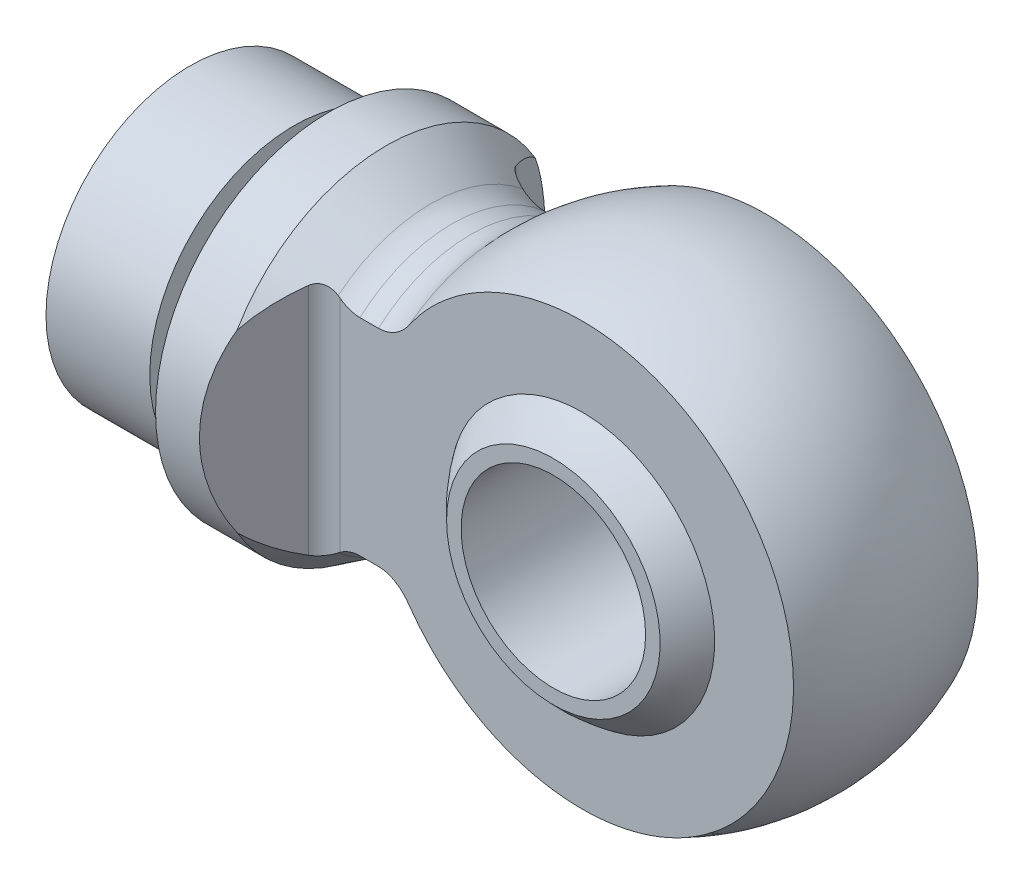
ISO-10303-21;
HEADER;
FILE_DESCRIPTION(('STEP AP214'),'2;1');
FILE_NAME('part.step','',(''),(''),'','','');
FILE_SCHEMA(('AUTOMOTIVE_DESIGN { 1 0 10303 214 1 1 1 1 }'));
ENDSEC;
DATA;
#1=APPLICATION_CONTEXT('core data for automotive mechanical design processes');
#2=APPLICATION_PROTOCOL_DEFINITION('international standard','automotive_design',2000,#1);
#3=PRODUCT_CONTEXT('',#1,'mechanical');
#4=PRODUCT('Part','Part','',(#3));
#5=PRODUCT_RELATED_PRODUCT_CATEGORY('part','',(#4));
#6=PRODUCT_DEFINITION_FORMATION('','',#4);
#7=PRODUCT_DEFINITION_CONTEXT('part definition',#1,'design');
#8=PRODUCT_DEFINITION('design','',#6,#7);
#9=PRODUCT_DEFINITION_SHAPE('','',#8);
#10=(LENGTH_UNIT() NAMED_UNIT(*) SI_UNIT(.MILLI.,.METRE.));
#11=(NAMED_UNIT(*) PLANE_ANGLE_UNIT() SI_UNIT($,.RADIAN.));
#12=(NAMED_UNIT(*) SI_UNIT($,.STERADIAN.) SOLID_ANGLE_UNIT());
#13=UNCERTAINTY_MEASURE_WITH_UNIT(LENGTH_MEASURE(1.E-05),#10,'distance_accuracy_value','');
#14=(GEOMETRIC_REPRESENTATION_CONTEXT(3) GLOBAL_UNCERTAINTY_ASSIGNED_CONTEXT((#13)) GLOBAL_UNIT_ASSIGNED_CONTEXT((#10,
#11,#12)) REPRESENTATION_CONTEXT('',''));
#15=CARTESIAN_POINT('',(0.,0.,0.));
#16=DIRECTION('',(0.,0.,1.));
#17=DIRECTION('',(1.,0.,0.));
#18=AXIS2_PLACEMENT_3D('',#15,#16,#17);
#19=CARTESIAN_POINT('',(30.,0.,-50.));
#20=DIRECTION('',(0.,0.,1.));
#21=DIRECTION('',(1.,0.,0.));
#22=AXIS2_PLACEMENT_3D('',#19,#20,#21);
#23=CYLINDRICAL_SURFACE('',#22,8.);
#24=CARTESIAN_POINT('',(30.,0.,-10.5));
#25=DIRECTION('',(0.,0.,1.));
#26=DIRECTION('',(1.,0.,0.));
#27=AXIS2_PLACEMENT_3D('',#24,#25,#26);
#28=CIRCLE('',#27,8.);
#29=CARTESIAN_POINT('',(38.,0.,-10.5));
#30=VERTEX_POINT('',#29);
#31=EDGE_CURVE('P0_E26',#30,#30,#28,.F.);
#32=ORIENTED_EDGE('',*,*,#31,.T.);
#33=EDGE_LOOP('',(#32));
#34=FACE_BOUND('',#33,.T.);
#35=CARTESIAN_POINT('',(30.,0.,10.5));
#36=DIRECTION('',(0.,0.,1.));
#37=DIRECTION('',(1.,0.,0.));
#38=AXIS2_PLACEMENT_3D('',#35,#36,#37);
#39=CIRCLE('',#38,8.);
#40=CARTESIAN_POINT('',(38.,0.,10.5));
#41=VERTEX_POINT('',#40);
#42=EDGE_CURVE('P0_E17',#41,#41,#39,.T.);
#43=ORIENTED_EDGE('',*,*,#42,.T.);
#44=EDGE_LOOP('',(#43));
#45=FACE_BOUND('',#44,.T.);
#46=ADVANCED_FACE('P0_F14',(#34,#45),#23,.F.);
#47=CARTESIAN_POINT('',(12.160017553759,-50.,10.5));
#48=DIRECTION('',(0.,0.,-1.));
#49=DIRECTION('',(-1.,0.,0.));
#50=AXIS2_PLACEMENT_3D('',#47,#48,#49);
#51=PLANE('',#50);
#52=CARTESIAN_POINT('',(30.,0.,10.5));
#53=DIRECTION('',(0.,0.,-1.));
#54=DIRECTION('',(-1.,0.,0.));
#55=AXIS2_PLACEMENT_3D('',#52,#53,#54);
#56=CIRCLE('',#55,9.26012958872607);
#57=CARTESIAN_POINT('',(20.7398704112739,0.,10.5));
#58=VERTEX_POINT('',#57);
#59=EDGE_CURVE('P0_E21',#58,#58,#56,.T.);
#60=ORIENTED_EDGE('',*,*,#59,.F.);
#61=EDGE_LOOP('',(#60));
#62=FACE_BOUND('',#61,.T.);
#63=ORIENTED_EDGE('',*,*,#42,.F.);
#64=EDGE_LOOP('',(#63));
#65=FACE_BOUND('',#64,.T.);
#66=ADVANCED_FACE('P0_F37',(#62,#65),#51,.F.);
#67=CARTESIAN_POINT('',(12.160017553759,-50.,-10.5));
#68=DIRECTION('',(0.,0.,1.));
#69=DIRECTION('',(1.,0.,0.));
#70=AXIS2_PLACEMENT_3D('',#67,#68,#69);
#71=PLANE('',#70);
#72=CARTESIAN_POINT('',(30.,0.,-10.5));
#73=DIRECTION('',(0.,0.,-1.));
#74=DIRECTION('',(-1.,0.,0.));
#75=AXIS2_PLACEMENT_3D('',#72,#73,#74);
#76=CIRCLE('',#75,9.26012958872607);
#77=CARTESIAN_POINT('',(20.7398704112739,0.,-10.5));
#78=VERTEX_POINT('',#77);
#79=EDGE_CURVE('P0_E10',#78,#78,#76,.F.);
#80=ORIENTED_EDGE('',*,*,#79,.F.);
#81=EDGE_LOOP('',(#80));
#82=FACE_BOUND('',#81,.T.);
#83=ORIENTED_EDGE('',*,*,#31,.F.);
#84=EDGE_LOOP('',(#83));
#85=FACE_BOUND('',#84,.T.);
#86=ADVANCED_FACE('P0_F39',(#82,#85),#71,.F.);
#87=CARTESIAN_POINT('',(30.,0.,0.));
#88=DIRECTION('',(0.,0.,-1.));
#89=DIRECTION('',(1.,0.,0.));
#90=AXIS2_PLACEMENT_3D('',#87,#88,#89);
#91=SPHERICAL_SURFACE('',#90,14.);
#92=ORIENTED_EDGE('',*,*,#59,.T.);
#93=EDGE_LOOP('',(#92));
#94=FACE_BOUND('',#93,.T.);
#95=ORIENTED_EDGE('',*,*,#79,.T.);
#96=EDGE_LOOP('',(#95));
#97=FACE_BOUND('',#96,.T.);
#98=ADVANCED_FACE('P0_F46',(#94,#97),#91,.T.);
#99=CLOSED_SHELL('',(#46,#66,#86,#98));
#100=MANIFOLD_SOLID_BREP('P0_B1',#99);
#101=CARTESIAN_POINT('',(-12.,0.,0.));
#102=DIRECTION('',(1.,0.,0.));
#103=DIRECTION('',(0.,0.,-1.));
#104=AXIS2_PLACEMENT_3D('',#101,#102,#103);
#105=PLANE('',#104);
#106=CARTESIAN_POINT('',(-12.,0.,0.));
#107=DIRECTION('',(-1.,0.,0.));
#108=DIRECTION('',(0.,0.,1.));
#109=AXIS2_PLACEMENT_3D('',#106,#107,#108);
#110=CIRCLE('',#109,12.5);
#111=CARTESIAN_POINT('',(-12.,0.,12.5));
#112=VERTEX_POINT('',#111);
#113=EDGE_CURVE('P1_E19',#112,#112,#110,.F.);
#114=ORIENTED_EDGE('',*,*,#113,.F.);
#115=EDGE_LOOP('',(#114));
#116=FACE_BOUND('',#115,.T.);
#117=ADVANCED_FACE('P1_F16',(#116),#105,.F.);
#118=CARTESIAN_POINT('',(-64.2002945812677,0.,0.));
#119=DIRECTION('',(-1.,0.,0.));
#120=DIRECTION('',(0.,0.,1.));
#121=AXIS2_PLACEMENT_3D('',#118,#119,#120);
#122=CYLINDRICAL_SURFACE('',#121,12.5);
#123=ORIENTED_EDGE('',*,*,#113,.T.);
#124=EDGE_LOOP('',(#123));
#125=FACE_BOUND('',#124,.T.);
#126=CARTESIAN_POINT('',(-3.,0.,0.));
#127=DIRECTION('',(-1.,0.,0.));
#128=DIRECTION('',(0.,0.,1.));
#129=AXIS2_PLACEMENT_3D('',#126,#127,#128);
#130=CIRCLE('',#129,12.5);
#131=CARTESIAN_POINT('',(-3.,0.,12.5));
#132=VERTEX_POINT('',#131);
#133=EDGE_CURVE('P1_E164',#132,#132,#130,.T.);
#134=ORIENTED_EDGE('',*,*,#133,.T.);
#135=EDGE_LOOP('',(#134));
#136=FACE_BOUND('',#135,.T.);
#137=ADVANCED_FACE('P1_F171',(#125,#136),#122,.T.);
#138=CARTESIAN_POINT('',(-3.,12.5,0.));
#139=DIRECTION('',(-1.,0.,0.));
#140=DIRECTION('',(0.,0.,1.));
#141=AXIS2_PLACEMENT_3D('',#138,#139,#140);
#142=PLANE('',#141);
#143=CARTESIAN_POINT('',(-3.,0.,0.));
#144=DIRECTION('',(-1.,0.,0.));
#145=DIRECTION('',(0.,0.,1.));
#146=AXIS2_PLACEMENT_3D('',#143,#144,#145);
#147=CIRCLE('',#146,10.5);
#148=CARTESIAN_POINT('',(-3.,0.,10.5));
#149=VERTEX_POINT('',#148);
#150=EDGE_CURVE('P1_E162',#149,#149,#147,.F.);
#151=ORIENTED_EDGE('',*,*,#150,.F.);
#152=EDGE_LOOP('',(#151));
#153=FACE_BOUND('',#152,.T.);
#154=ORIENTED_EDGE('',*,*,#133,.F.);
#155=EDGE_LOOP('',(#154));
#156=FACE_BOUND('',#155,.T.);
#157=ADVANCED_FACE('P1_F178',(#153,#156),#142,.F.);
#158=CARTESIAN_POINT('',(-64.2002945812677,0.,0.));
#159=DIRECTION('',(-1.,0.,0.));
#160=DIRECTION('',(0.,0.,1.));
#161=AXIS2_PLACEMENT_3D('',#158,#159,#160);
#162=CYLINDRICAL_SURFACE('',#161,10.5);
#163=ORIENTED_EDGE('',*,*,#150,.T.);
#164=EDGE_LOOP('',(#163));
#165=FACE_BOUND('',#164,.T.);
#166=CARTESIAN_POINT('',(0.,0.,0.));
#167=DIRECTION('',(-1.,0.,0.));
#168=DIRECTION('',(0.,0.,1.));
#169=AXIS2_PLACEMENT_3D('',#166,#167,#168);
#170=CIRCLE('',#169,10.5);
#171=CARTESIAN_POINT('',(0.,0.,10.5));
#172=VERTEX_POINT('',#171);
#173=EDGE_CURVE('P1_E159',#172,#172,#170,.T.);
#174=ORIENTED_EDGE('',*,*,#173,.T.);
#175=EDGE_LOOP('',(#174));
#176=FACE_BOUND('',#175,.T.);
#177=ADVANCED_FACE('P1_F420',(#165,#176),#162,.T.);
#178=CARTESIAN_POINT('',(0.,10.5,0.));
#179=DIRECTION('',(1.,0.,0.));
#180=DIRECTION('',(0.,0.,-1.));
#181=AXIS2_PLACEMENT_3D('',#178,#179,#180);
#182=PLANE('',#181);
#183=CARTESIAN_POINT('',(0.,0.,0.));
#184=DIRECTION('',(-1.,0.,0.));
#185=DIRECTION('',(0.,0.,1.));
#186=AXIS2_PLACEMENT_3D('',#183,#184,#185);
#187=CIRCLE('',#186,15.);
#188=CARTESIAN_POINT('',(0.,0.,15.));
#189=VERTEX_POINT('',#188);
#190=EDGE_CURVE('P1_E126',#189,#189,#187,.F.);
#191=ORIENTED_EDGE('',*,*,#190,.F.);
#192=EDGE_LOOP('',(#191));
#193=FACE_BOUND('',#192,.T.);
#194=ORIENTED_EDGE('',*,*,#173,.F.);
#195=EDGE_LOOP('',(#194));
#196=FACE_BOUND('',#195,.T.);
#197=ADVANCED_FACE('P1_F411',(#193,#196),#182,.F.);
#198=CARTESIAN_POINT('',(-64.2002945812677,0.,0.));
#199=DIRECTION('',(-1.,0.,0.));
#200=DIRECTION('',(0.,0.,1.));
#201=AXIS2_PLACEMENT_3D('',#198,#199,#200);
#202=CYLINDRICAL_SURFACE('',#201,15.);
#203=ORIENTED_EDGE('',*,*,#190,.T.);
#204=EDGE_LOOP('',(#203));
#205=FACE_BOUND('',#204,.T.);
#206=CARTESIAN_POINT('',(12.4641016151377,0.,0.));
#207=DIRECTION('',(-0.86602540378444,0.,-0.499999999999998));
#208=DIRECTION('',(-0.499999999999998,0.,0.86602540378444));
#209=AXIS2_PLACEMENT_3D('',#206,#207,#208);
#210=ELLIPSE('',#209,17.3205080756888,15.);
#211=CARTESIAN_POINT('',(5.,-7.60667872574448,12.9282032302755));
#212=VERTEX_POINT('',#211);
#213=CARTESIAN_POINT('',(5.,7.60667872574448,12.9282032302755));
#214=VERTEX_POINT('',#213);
#215=EDGE_CURVE('P1_E132',#212,#214,#210,.T.);
#216=ORIENTED_EDGE('',*,*,#215,.T.);
#217=CARTESIAN_POINT('',(5.,0.,0.));
#218=DIRECTION('',(-1.,0.,0.));
#219=DIRECTION('',(0.,0.,1.));
#220=AXIS2_PLACEMENT_3D('',#217,#218,#219);
#221=CIRCLE('',#220,15.);
#222=CARTESIAN_POINT('',(5.00000000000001,7.60667872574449,-12.9282032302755));
#223=VERTEX_POINT('',#222);
#224=EDGE_CURVE('P1_E129',#223,#214,#221,.F.);
#225=ORIENTED_EDGE('',*,*,#224,.F.);
#226=CARTESIAN_POINT('',(12.4641016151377,0.,0.));
#227=DIRECTION('',(-0.86602540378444,0.,0.499999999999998));
#228=DIRECTION('',(-0.499999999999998,0.,-0.86602540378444));
#229=AXIS2_PLACEMENT_3D('',#226,#227,#228);
#230=ELLIPSE('',#229,17.3205080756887,15.);
#231=CARTESIAN_POINT('',(5.00000000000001,-7.60667872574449,-12.9282032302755));
#232=VERTEX_POINT('',#231);
#233=EDGE_CURVE('P1_E115',#223,#232,#230,.T.);
#234=ORIENTED_EDGE('',*,*,#233,.T.);
#235=CARTESIAN_POINT('',(5.,0.,0.));
#236=DIRECTION('',(-1.,0.,0.));
#237=DIRECTION('',(0.,0.,1.));
#238=AXIS2_PLACEMENT_3D('',#235,#236,#237);
#239=CIRCLE('',#238,15.);
#240=EDGE_CURVE('P1_E125',#212,#232,#239,.F.);
#241=ORIENTED_EDGE('',*,*,#240,.F.);
#242=EDGE_LOOP('',(#216,#225,#234,#241));
#243=FACE_BOUND('',#242,.T.);
#244=ADVANCED_FACE('P1_F130',(#205,#243),#202,.T.);
#245=CARTESIAN_POINT('',(-1.96965511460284,-50.,-25.));
#246=DIRECTION('',(-0.86602540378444,0.,0.499999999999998));
#247=DIRECTION('',(0.499999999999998,0.,0.86602540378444));
#248=AXIS2_PLACEMENT_3D('',#245,#246,#247);
#249=PLANE('',#248);
#250=CARTESIAN_POINT('',(9.94764334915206,0.,-4.35863357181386));
#251=DIRECTION('',(-0.86602540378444,0.,0.499999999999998));
#252=DIRECTION('',(-0.499999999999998,0.,-0.86602540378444));
#253=AXIS2_PLACEMENT_3D('',#250,#251,#252);
#254=ELLIPSE('',#253,13.6799998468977,11.016311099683);
#255=CARTESIAN_POINT('',(7.26794919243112,10.1357109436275,-9.00000000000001));
#256=VERTEX_POINT('',#255);
#257=EDGE_CURVE('P1_E119',#256,#223,#254,.T.);
#258=ORIENTED_EDGE('',*,*,#257,.F.);
#259=DIRECTION('',(0.,1.,0.));
#260=VECTOR('',#259,1.);
#261=CARTESIAN_POINT('',(7.26794919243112,-50.,-9.00000000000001));
#262=LINE('',#261,#260);
#263=CARTESIAN_POINT('',(7.26794919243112,-10.1357109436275,-9.00000000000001));
#264=VERTEX_POINT('',#263);
#265=EDGE_CURVE('P1_E535',#256,#264,#262,.F.);
#266=ORIENTED_EDGE('',*,*,#265,.T.);
#267=CARTESIAN_POINT('',(9.94764334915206,0.,-4.35863357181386));
#268=DIRECTION('',(-0.86602540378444,0.,0.499999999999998));
#269=DIRECTION('',(-0.499999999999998,0.,-0.86602540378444));
#270=AXIS2_PLACEMENT_3D('',#267,#268,#269);
#271=ELLIPSE('',#270,13.6799998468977,11.016311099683);
#272=EDGE_CURVE('P1_E122',#232,#264,#271,.T.);
#273=ORIENTED_EDGE('',*,*,#272,.F.);
#274=ORIENTED_EDGE('',*,*,#233,.F.);
#275=EDGE_LOOP('',(#258,#266,#273,#274));
#276=FACE_BOUND('',#275,.T.);
#277=ADVANCED_FACE('P1_F117',(#276),#249,.F.);
#278=CARTESIAN_POINT('',(5.,0.,0.));
#279=DIRECTION('',(-1.,0.,0.));
#280=DIRECTION('',(0.,0.,1.));
#281=AXIS2_PLACEMENT_3D('',#278,#279,#280);
#282=CONICAL_SURFACE('',#281,15.,0.56734358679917);
#283=ORIENTED_EDGE('',*,*,#272,.T.);
#284=CARTESIAN_POINT('',(7.26794919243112,-10.1357109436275,-9.));
#285=CARTESIAN_POINT('',(7.28551516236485,-10.1477609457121,-8.96957189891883));
#286=CARTESIAN_POINT('',(7.30407283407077,-10.1586975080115,-8.93928640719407));
#287=CARTESIAN_POINT('',(7.34315740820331,-10.1782163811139,-8.87921526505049));
#288=CARTESIAN_POINT('',(7.3636851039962,-10.1867977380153,-8.84942982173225));
#289=CARTESIAN_POINT('',(7.42802023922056,-10.2087501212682,-8.76140045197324));
#290=CARTESIAN_POINT('',(7.47471021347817,-10.2184206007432,-8.70425475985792));
#291=CARTESIAN_POINT('',(7.57473056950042,-10.2274024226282,-8.59496750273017));
#292=CARTESIAN_POINT('',(7.62807839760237,-10.2266859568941,-8.54283974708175));
#293=CARTESIAN_POINT('',(7.73960361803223,-10.215286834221,-8.44536643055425));
#294=CARTESIAN_POINT('',(7.7977790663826,-10.2046081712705,-8.40001816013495));
#295=CARTESIAN_POINT('',(7.91549747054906,-10.1748022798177,-8.31807702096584));
#296=CARTESIAN_POINT('',(7.97496045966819,-10.1559122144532,-8.28127993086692));
#297=CARTESIAN_POINT('',(8.09528406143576,-10.1109971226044,-8.21500149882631));
#298=CARTESIAN_POINT('',(8.15614632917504,-10.0849632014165,-8.18552936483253));
#299=CARTESIAN_POINT('',(8.30947470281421,-10.0120646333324,-8.1203074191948));
#300=CARTESIAN_POINT('',(8.40207488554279,-9.96137695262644,-8.08914112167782));
#301=CARTESIAN_POINT('',(8.58486965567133,-9.85014276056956,-8.04126992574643));
#302=CARTESIAN_POINT('',(8.67506319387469,-9.78959202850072,-8.02457123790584));
#303=CARTESIAN_POINT('',(8.79150994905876,-9.70487500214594,-8.01069435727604));
#304=CARTESIAN_POINT('',(8.81956515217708,-9.68394398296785,-8.00796217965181));
#305=CARTESIAN_POINT('',(8.84738826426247,-9.6626859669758,-8.00583108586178));
#306=B_SPLINE_CURVE_WITH_KNOTS('',3,(#284,#285,#286,#287,#288,#289,#290,#291,#292,#293,#294,
#295,#296,#297,#298,#299,#300,#301,#302,#303,#304,#305),.UNSPECIFIED.,.F.,.F.,(4,2,2,2,2,2,2,2,
2,2,4),(0.,0.111376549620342,0.222798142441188,0.444816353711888,0.667429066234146,
0.889952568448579,1.10643669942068,1.32319160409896,1.65157322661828,1.98009574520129,
2.08538004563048),.UNSPECIFIED.);
#307=CARTESIAN_POINT('',(8.84738826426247,-9.66268596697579,-8.00583108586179));
#308=VERTEX_POINT('',#307);
#309=EDGE_CURVE('P1_E469',#264,#308,#306,.T.);
#310=ORIENTED_EDGE('',*,*,#309,.T.);
#311=CARTESIAN_POINT('',(8.84738826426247,0.,0.));
#312=DIRECTION('',(-1.,0.,0.));
#313=DIRECTION('',(0.,0.,1.));
#314=AXIS2_PLACEMENT_3D('',#311,#312,#313);
#315=CIRCLE('',#314,12.5483397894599);
#316=CARTESIAN_POINT('',(8.84738826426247,-9.66268596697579,8.00583108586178));
#317=VERTEX_POINT('',#316);
#318=EDGE_CURVE('P1_E525',#308,#317,#315,.T.);
#319=ORIENTED_EDGE('',*,*,#318,.T.);
#320=CARTESIAN_POINT('',(8.84738826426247,-9.66268596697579,8.00583108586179));
#321=CARTESIAN_POINT('',(8.76253252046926,-9.72749930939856,8.01232265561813));
#322=CARTESIAN_POINT('',(8.67529816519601,-9.78944982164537,8.02445930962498));
#323=CARTESIAN_POINT('',(8.49711190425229,-9.90533951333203,8.06209002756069));
#324=CARTESIAN_POINT('',(8.40612998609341,-9.95918475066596,8.08772720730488));
#325=CARTESIAN_POINT('',(8.24237406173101,-10.0450989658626,8.14745259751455));
#326=CARTESIAN_POINT('',(8.16974042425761,-10.0793681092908,8.17868223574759));
#327=CARTESIAN_POINT('',(8.02599840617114,-10.1383413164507,8.25135391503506));
#328=CARTESIAN_POINT('',(7.95488488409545,-10.163085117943,8.29275232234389));
#329=CARTESIAN_POINT('',(7.82666863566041,-10.1982282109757,8.37878704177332));
#330=CARTESIAN_POINT('',(7.76906119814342,-10.210219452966,8.42201295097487));
#331=CARTESIAN_POINT('',(7.6581448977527,-10.2247917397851,8.51518906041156));
#332=CARTESIAN_POINT('',(7.60483811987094,-10.2273682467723,8.56514249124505));
#333=CARTESIAN_POINT('',(7.50413295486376,-10.2225373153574,8.67044947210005));
#334=CARTESIAN_POINT('',(7.45674728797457,-10.2151087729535,8.72581420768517));
#335=CARTESIAN_POINT('',(7.36926724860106,-10.1904641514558,8.83988583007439));
#336=CARTESIAN_POINT('',(7.32916163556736,-10.1732633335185,8.89858737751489));
#337=CARTESIAN_POINT('',(7.2843847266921,-10.146604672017,8.97192476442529));
#338=CARTESIAN_POINT('',(7.27605761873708,-10.1412759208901,8.98595143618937));
#339=CARTESIAN_POINT('',(7.26794919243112,-10.1357109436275,9.00000000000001));
#340=B_SPLINE_CURVE_WITH_KNOTS('',3,(#320,#321,#322,#323,#324,#325,#326,#327,#328,#329,#330,
#331,#332,#333,#334,#335,#336,#337,#338,#339),.UNSPECIFIED.,.F.,.F.,(4,2,2,2,2,2,2,2,2,4),(0.,
0.321501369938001,0.64648161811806,0.904009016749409,1.16045011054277,1.37853566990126,
1.59672633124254,1.81537795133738,2.03368904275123,2.08515540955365),.UNSPECIFIED.);
#341=CARTESIAN_POINT('',(7.26794919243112,-10.1357109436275,9.00000000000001));
#342=VERTEX_POINT('',#341);
#343=EDGE_CURVE('P1_E475',#317,#342,#340,.T.);
#344=ORIENTED_EDGE('',*,*,#343,.T.);
#345=CARTESIAN_POINT('',(9.94764334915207,0.,4.35863357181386));
#346=DIRECTION('',(-0.86602540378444,0.,-0.499999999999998));
#347=DIRECTION('',(-0.499999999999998,0.,0.86602540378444));
#348=AXIS2_PLACEMENT_3D('',#345,#346,#347);
#349=ELLIPSE('',#348,13.6799998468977,11.016311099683);
#350=EDGE_CURVE('P1_E153',#342,#212,#349,.T.);
#351=ORIENTED_EDGE('',*,*,#350,.T.);
#352=ORIENTED_EDGE('',*,*,#240,.T.);
#353=EDGE_LOOP('',(#283,#310,#319,#344,#351,#352));
#354=FACE_BOUND('',#353,.T.);
#355=ADVANCED_FACE('P1_F387',(#354),#282,.T.);
#356=CARTESIAN_POINT('',(-1.96965511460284,-50.,25.));
#357=DIRECTION('',(-0.86602540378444,0.,-0.499999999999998));
#358=DIRECTION('',(-0.499999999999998,0.,0.86602540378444));
#359=AXIS2_PLACEMENT_3D('',#356,#357,#358);
#360=PLANE('',#359);
#361=ORIENTED_EDGE('',*,*,#350,.F.);
#362=DIRECTION('',(0.,1.,0.));
#363=VECTOR('',#362,1.);
#364=CARTESIAN_POINT('',(7.26794919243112,-50.,9.00000000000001));
#365=LINE('',#364,#363);
#366=CARTESIAN_POINT('',(7.26794919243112,10.1357109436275,9.00000000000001));
#367=VERTEX_POINT('',#366);
#368=EDGE_CURVE('P1_E481',#342,#367,#365,.T.);
#369=ORIENTED_EDGE('',*,*,#368,.T.);
#370=CARTESIAN_POINT('',(9.94764334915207,0.,4.35863357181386));
#371=DIRECTION('',(-0.86602540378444,0.,-0.499999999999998));
#372=DIRECTION('',(-0.499999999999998,0.,0.86602540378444));
#373=AXIS2_PLACEMENT_3D('',#370,#371,#372);
#374=ELLIPSE('',#373,13.6799998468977,11.016311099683);
#375=EDGE_CURVE('P1_E141',#214,#367,#374,.T.);
#376=ORIENTED_EDGE('',*,*,#375,.F.);
#377=ORIENTED_EDGE('',*,*,#215,.F.);
#378=EDGE_LOOP('',(#361,#369,#376,#377));
#379=FACE_BOUND('',#378,.T.);
#380=ADVANCED_FACE('P1_F380',(#379),#360,.F.);
#381=CARTESIAN_POINT('',(5.,0.,0.));
#382=DIRECTION('',(-1.,0.,0.));
#383=DIRECTION('',(0.,0.,1.));
#384=AXIS2_PLACEMENT_3D('',#381,#382,#383);
#385=CONICAL_SURFACE('',#384,15.,0.56734358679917);
#386=ORIENTED_EDGE('',*,*,#257,.T.);
#387=ORIENTED_EDGE('',*,*,#224,.T.);
#388=ORIENTED_EDGE('',*,*,#375,.T.);
#389=CARTESIAN_POINT('',(7.26794919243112,10.1357109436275,9.));
#390=CARTESIAN_POINT('',(7.28551516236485,10.1477609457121,8.96957189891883));
#391=CARTESIAN_POINT('',(7.30407283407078,10.1586975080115,8.93928640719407));
#392=CARTESIAN_POINT('',(7.34315740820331,10.1782163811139,8.87921526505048));
#393=CARTESIAN_POINT('',(7.3636851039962,10.1867977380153,8.84942982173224));
#394=CARTESIAN_POINT('',(7.42802023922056,10.2087501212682,8.76140045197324));
#395=CARTESIAN_POINT('',(7.47471021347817,10.2184206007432,8.70425475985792));
#396=CARTESIAN_POINT('',(7.57473056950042,10.2274024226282,8.59496750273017));
#397=CARTESIAN_POINT('',(7.62807839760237,10.2266859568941,8.54283974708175));
#398=CARTESIAN_POINT('',(7.73960361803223,10.215286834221,8.44536643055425));
#399=CARTESIAN_POINT('',(7.7977790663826,10.2046081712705,8.40001816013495));
#400=CARTESIAN_POINT('',(7.91549747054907,10.1748022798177,8.31807702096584));
#401=CARTESIAN_POINT('',(7.97496045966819,10.1559122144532,8.28127993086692));
#402=CARTESIAN_POINT('',(8.09528406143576,10.1109971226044,8.2150014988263));
#403=CARTESIAN_POINT('',(8.15614632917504,10.0849632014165,8.18552936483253));
#404=CARTESIAN_POINT('',(8.30947470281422,10.0120646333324,8.1203074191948));
#405=CARTESIAN_POINT('',(8.40207488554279,9.96137695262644,8.08914112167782));
#406=CARTESIAN_POINT('',(8.58486965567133,9.85014276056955,8.04126992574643));
#407=CARTESIAN_POINT('',(8.6750631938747,9.78959202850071,8.02457123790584));
#408=CARTESIAN_POINT('',(8.79150994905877,9.70487500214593,8.01069435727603));
#409=CARTESIAN_POINT('',(8.81956515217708,9.68394398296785,8.00796217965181));
#410=CARTESIAN_POINT('',(8.84738826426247,9.6626859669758,8.00583108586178));
#411=B_SPLINE_CURVE_WITH_KNOTS('',3,(#389,#390,#391,#392,#393,#394,#395,#396,#397,#398,#399,
#400,#401,#402,#403,#404,#405,#406,#407,#408,#409,#410),.UNSPECIFIED.,.F.,.F.,(4,2,2,2,2,2,2,2,
2,2,4),(0.,0.111376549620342,0.222798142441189,0.444816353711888,0.667429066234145,
0.889952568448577,1.10643669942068,1.32319160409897,1.65157322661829,1.98009574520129,
2.08538004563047),.UNSPECIFIED.);
#412=CARTESIAN_POINT('',(8.84738826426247,9.66268596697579,8.00583108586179));
#413=VERTEX_POINT('',#412);
#414=EDGE_CURVE('P1_E483',#367,#413,#411,.T.);
#415=ORIENTED_EDGE('',*,*,#414,.T.);
#416=CARTESIAN_POINT('',(8.84738826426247,0.,0.));
#417=DIRECTION('',(-1.,0.,0.));
#418=DIRECTION('',(0.,0.,1.));
#419=AXIS2_PLACEMENT_3D('',#416,#417,#418);
#420=CIRCLE('',#419,12.5483397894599);
#421=CARTESIAN_POINT('',(8.84738826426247,9.66268596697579,-8.00583108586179));
#422=VERTEX_POINT('',#421);
#423=EDGE_CURVE('P1_E505',#413,#422,#420,.T.);
#424=ORIENTED_EDGE('',*,*,#423,.T.);
#425=CARTESIAN_POINT('',(8.84738826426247,9.66268596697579,-8.00583108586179));
#426=CARTESIAN_POINT('',(8.76253252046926,9.72749930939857,-8.01232265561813));
#427=CARTESIAN_POINT('',(8.67529816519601,9.78944982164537,-8.02445930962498));
#428=CARTESIAN_POINT('',(8.49711190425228,9.90533951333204,-8.0620900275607));
#429=CARTESIAN_POINT('',(8.40612998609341,9.95918475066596,-8.08772720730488));
#430=CARTESIAN_POINT('',(8.242374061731,10.0450989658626,-8.14745259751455));
#431=CARTESIAN_POINT('',(8.1697404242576,10.0793681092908,-8.17868223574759));
#432=CARTESIAN_POINT('',(8.02599840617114,10.1383413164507,-8.25135391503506));
#433=CARTESIAN_POINT('',(7.95488488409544,10.163085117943,-8.29275232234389));
#434=CARTESIAN_POINT('',(7.82666863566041,10.1982282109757,-8.37878704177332));
#435=CARTESIAN_POINT('',(7.76906119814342,10.210219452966,-8.42201295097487));
#436=CARTESIAN_POINT('',(7.6581448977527,10.2247917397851,-8.51518906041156));
#437=CARTESIAN_POINT('',(7.60483811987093,10.2273682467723,-8.56514249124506));
#438=CARTESIAN_POINT('',(7.50413295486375,10.2225373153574,-8.67044947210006));
#439=CARTESIAN_POINT('',(7.45674728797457,10.2151087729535,-8.72581420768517));
#440=CARTESIAN_POINT('',(7.36926724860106,10.1904641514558,-8.83988583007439));
#441=CARTESIAN_POINT('',(7.32916163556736,10.1732633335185,-8.89858737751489));
#442=CARTESIAN_POINT('',(7.2843847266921,10.146604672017,-8.97192476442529));
#443=CARTESIAN_POINT('',(7.27605761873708,10.1412759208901,-8.98595143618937));
#444=CARTESIAN_POINT('',(7.26794919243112,10.1357109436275,-9.00000000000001));
#445=B_SPLINE_CURVE_WITH_KNOTS('',3,(#425,#426,#427,#428,#429,#430,#431,#432,#433,#434,#435,
#436,#437,#438,#439,#440,#441,#442,#443,#444),.UNSPECIFIED.,.F.,.F.,(4,2,2,2,2,2,2,2,2,4),(0.,
0.321501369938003,0.646481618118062,0.904009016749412,1.16045011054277,1.37853566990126,
1.59672633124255,1.81537795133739,2.03368904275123,2.08515540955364),.UNSPECIFIED.);
#446=EDGE_CURVE('P1_E136',#422,#256,#445,.T.);
#447=ORIENTED_EDGE('',*,*,#446,.T.);
#448=EDGE_LOOP('',(#386,#387,#388,#415,#424,#447));
#449=FACE_BOUND('',#448,.T.);
#450=ADVANCED_FACE('P1_F138',(#449),#385,.T.);
#451=CARTESIAN_POINT('',(9.,-50.,-10.));
#452=DIRECTION('',(0.,1.,0.));
#453=DIRECTION('',(0.,0.,1.));
#454=AXIS2_PLACEMENT_3D('',#451,#452,#453);
#455=CYLINDRICAL_SURFACE('',#454,2.);
#456=ORIENTED_EDGE('',*,*,#265,.F.);
#457=ORIENTED_EDGE('',*,*,#446,.F.);
#458=CARTESIAN_POINT('',(8.84738826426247,9.66268596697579,-8.00583108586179));
#459=CARTESIAN_POINT('',(8.87265771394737,9.64339366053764,-8.00389266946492));
#460=CARTESIAN_POINT('',(8.89801008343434,9.62418709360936,-8.00243753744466));
#461=CARTESIAN_POINT('',(8.94888066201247,9.58594543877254,-8.00049384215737));
#462=CARTESIAN_POINT('',(8.97439887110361,9.56691035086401,-8.00000527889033));
#463=CARTESIAN_POINT('',(8.99999999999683,9.54796100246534,-7.99999999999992));
#464=B_SPLINE_CURVE_WITH_KNOTS('',3,(#458,#459,#460,#461,#462,#463),.UNSPECIFIED.,.F.,.F.,(4,2,
4),(0.,0.095518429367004,0.191036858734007),.UNSPECIFIED.);
#465=CARTESIAN_POINT('',(8.99999999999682,9.54796100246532,-8.));
#466=VERTEX_POINT('',#465);
#467=EDGE_CURVE('P1_E511',#422,#466,#464,.T.);
#468=ORIENTED_EDGE('',*,*,#467,.T.);
#469=DIRECTION('',(0.,1.,0.));
#470=VECTOR('',#469,1.);
#471=CARTESIAN_POINT('',(9.,-50.,-8.));
#472=LINE('',#471,#470);
#473=CARTESIAN_POINT('',(8.99999999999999,-9.54796100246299,-8.));
#474=VERTEX_POINT('',#473);
#475=EDGE_CURVE('P1_E585',#466,#474,#472,.F.);
#476=ORIENTED_EDGE('',*,*,#475,.T.);
#477=CARTESIAN_POINT('',(8.99999999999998,-9.54796100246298,-7.99999999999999));
#478=CARTESIAN_POINT('',(8.97439887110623,-9.56691035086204,-8.00000527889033));
#479=CARTESIAN_POINT('',(8.94888066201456,-9.58594543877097,-8.00049384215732));
#480=CARTESIAN_POINT('',(8.89801008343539,-9.62418709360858,-8.00243753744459));
#481=CARTESIAN_POINT('',(8.87265771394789,-9.64339366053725,-8.00389266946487));
#482=CARTESIAN_POINT('',(8.84738826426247,-9.66268596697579,-8.00583108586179));
#483=B_SPLINE_CURVE_WITH_KNOTS('',3,(#477,#478,#479,#480,#481,#482),.UNSPECIFIED.,.F.,.F.,(4,2,
4),(0.,0.0955184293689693,0.191036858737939),.UNSPECIFIED.);
#484=EDGE_CURVE('P1_E520',#474,#308,#483,.T.);
#485=ORIENTED_EDGE('',*,*,#484,.T.);
#486=ORIENTED_EDGE('',*,*,#309,.F.);
#487=EDGE_LOOP('',(#456,#457,#468,#476,#485,#486));
#488=FACE_BOUND('',#487,.T.);
#489=ADVANCED_FACE('P1_F364',(#488),#455,.F.);
#490=CARTESIAN_POINT('',(-64.2002945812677,0.,0.));
#491=DIRECTION('',(-1.,0.,0.));
#492=DIRECTION('',(0.,0.,1.));
#493=AXIS2_PLACEMENT_3D('',#490,#491,#492);
#494=CYLINDRICAL_SURFACE('',#493,12.);
#495=CARTESIAN_POINT('',(12.3364782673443,0.,0.));
#496=DIRECTION('',(-1.,0.,0.));
#497=DIRECTION('',(0.,0.,1.));
#498=AXIS2_PLACEMENT_3D('',#495,#496,#497);
#499=CIRCLE('',#498,12.);
#500=CARTESIAN_POINT('',(12.3364782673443,8.94427190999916,8.));
#501=VERTEX_POINT('',#500);
#502=CARTESIAN_POINT('',(12.3364782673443,8.94427190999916,-8.));
#503=VERTEX_POINT('',#502);
#504=EDGE_CURVE('P1_E217',#501,#503,#499,.T.);
#505=ORIENTED_EDGE('',*,*,#504,.T.);
#506=DIRECTION('',(1.,0.,0.));
#507=VECTOR('',#506,1.);
#508=CARTESIAN_POINT('',(9.,8.94427190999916,-8.));
#509=LINE('',#508,#507);
#510=CARTESIAN_POINT('',(10.7282662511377,8.94427190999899,-8.));
#511=VERTEX_POINT('',#510);
#512=EDGE_CURVE('P1_E552',#503,#511,#509,.F.);
#513=ORIENTED_EDGE('',*,*,#512,.T.);
#514=CARTESIAN_POINT('',(10.7282662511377,0.,0.));
#515=DIRECTION('',(-1.,0.,0.));
#516=DIRECTION('',(0.,0.,1.));
#517=AXIS2_PLACEMENT_3D('',#514,#515,#516);
#518=CIRCLE('',#517,12.);
#519=CARTESIAN_POINT('',(10.7282662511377,8.94427190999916,8.));
#520=VERTEX_POINT('',#519);
#521=EDGE_CURVE('P1_E506',#511,#520,#518,.F.);
#522=ORIENTED_EDGE('',*,*,#521,.T.);
#523=DIRECTION('',(-1.,0.,0.));
#524=VECTOR('',#523,1.);
#525=CARTESIAN_POINT('',(-64.2002945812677,8.94427190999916,8.));
#526=LINE('',#525,#524);
#527=EDGE_CURVE('P1_E526',#520,#501,#526,.F.);
#528=ORIENTED_EDGE('',*,*,#527,.T.);
#529=EDGE_LOOP('',(#505,#513,#522,#528));
#530=FACE_BOUND('',#529,.T.);
#531=ADVANCED_FACE('P1_F356',(#530),#494,.T.);
#532=CARTESIAN_POINT('',(10.7282662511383,0.,0.));
#533=DIRECTION('',(-1.,0.,0.));
#534=DIRECTION('',(0.,0.,1.));
#535=AXIS2_PLACEMENT_3D('',#532,#533,#534);
#536=TOROIDAL_SURFACE('',#535,15.5,3.5);
#537=CARTESIAN_POINT('',(8.99999999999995,-9.54796100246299,8.00000000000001));
#538=CARTESIAN_POINT('',(8.9743988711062,-9.56691035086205,8.00000527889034));
#539=CARTESIAN_POINT('',(8.94888066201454,-9.58594543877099,8.00049384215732));
#540=CARTESIAN_POINT('',(8.89801008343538,-9.62418709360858,8.00243753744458));
#541=CARTESIAN_POINT('',(8.87265771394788,-9.64339366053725,8.00389266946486));
#542=CARTESIAN_POINT('',(8.84738826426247,-9.66268596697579,8.00583108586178));
#543=B_SPLINE_CURVE_WITH_KNOTS('',3,(#537,#538,#539,#540,#541,#542),.UNSPECIFIED.,.F.,.F.,(4,2,
4),(0.,0.0955184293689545,0.191036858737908),.UNSPECIFIED.);
#544=CARTESIAN_POINT('',(8.99999999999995,-9.547961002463,8.));
#545=VERTEX_POINT('',#544);
#546=EDGE_CURVE('P1_E482',#545,#317,#543,.T.);
#547=ORIENTED_EDGE('',*,*,#546,.T.);
#548=ORIENTED_EDGE('',*,*,#318,.F.);
#549=ORIENTED_EDGE('',*,*,#484,.F.);
#550=CARTESIAN_POINT('',(8.99999999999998,-9.54796100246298,-7.99999999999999));
#551=CARTESIAN_POINT('',(9.06693711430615,-9.49836776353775,-8.));
#552=CARTESIAN_POINT('',(9.13564913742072,-9.45111935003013,-8.));
#553=CARTESIAN_POINT('',(9.27647004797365,-9.36183258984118,-8.));
#554=CARTESIAN_POINT('',(9.34858226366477,-9.31979950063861,-8.));
#555=CARTESIAN_POINT('',(9.49392709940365,-9.24262128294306,-8.));
#556=CARTESIAN_POINT('',(9.56707691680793,-9.20732083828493,-8.));
#557=CARTESIAN_POINT('',(9.71599859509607,-9.14278452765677,-8.));
#558=CARTESIAN_POINT('',(9.79176989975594,-9.11354738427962,-8.));
#559=CARTESIAN_POINT('',(9.93693326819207,-9.06454702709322,-8.));
#560=CARTESIAN_POINT('',(10.0060912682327,-9.04409002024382,-8.));
#561=CARTESIAN_POINT('',(10.1458025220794,-9.00867518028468,-8.));
#562=CARTESIAN_POINT('',(10.2163556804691,-8.99371697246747,-8.));
#563=CARTESIAN_POINT('',(10.3601639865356,-8.96926755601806,-8.));
#564=CARTESIAN_POINT('',(10.4334432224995,-8.9599172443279,-8.));
#565=CARTESIAN_POINT('',(10.5805673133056,-8.94740724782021,-8.));
#566=CARTESIAN_POINT('',(10.6544124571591,-8.94425097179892,-8.));
#567=CARTESIAN_POINT('',(10.7282662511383,-8.94427190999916,-8.));
#568=B_SPLINE_CURVE_WITH_KNOTS('',3,(#550,#551,#552,#553,#554,#555,#556,#557,#558,#559,#560,
#561,#562,#563,#564,#565,#566,#567),.UNSPECIFIED.,.F.,.F.,(4,2,2,2,2,2,2,2,4),(0.,
0.249915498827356,0.500080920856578,0.743492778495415,0.986853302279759,1.20300199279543,
1.4191359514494,1.64049460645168,1.86197504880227),.UNSPECIFIED.);
#569=CARTESIAN_POINT('',(10.7282662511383,-8.94427190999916,-8.));
#570=VERTEX_POINT('',#569);
#571=EDGE_CURVE('P1_E507',#474,#570,#568,.T.);
#572=ORIENTED_EDGE('',*,*,#571,.T.);
#573=CARTESIAN_POINT('',(10.7282662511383,0.,0.));
#574=DIRECTION('',(-1.,0.,0.));
#575=DIRECTION('',(0.,0.,1.));
#576=AXIS2_PLACEMENT_3D('',#573,#574,#575);
#577=CIRCLE('',#576,12.);
#578=CARTESIAN_POINT('',(10.7282662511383,-8.94427190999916,8.));
#579=VERTEX_POINT('',#578);
#580=EDGE_CURVE('P1_E562',#579,#570,#577,.F.);
#581=ORIENTED_EDGE('',*,*,#580,.F.);
#582=CARTESIAN_POINT('',(10.7282662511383,-8.94427190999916,8.));
#583=CARTESIAN_POINT('',(10.6452034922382,-8.94423969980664,8.));
#584=CARTESIAN_POINT('',(10.5621580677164,-8.94823785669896,8.));
#585=CARTESIAN_POINT('',(10.3968746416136,-8.9640478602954,8.));
#586=CARTESIAN_POINT('',(10.3146360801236,-8.97585383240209,8.));
#587=CARTESIAN_POINT('',(10.1537320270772,-9.00662766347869,8.));
#588=CARTESIAN_POINT('',(10.0750292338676,-9.02540127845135,8.));
#589=CARTESIAN_POINT('',(9.91957752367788,-9.06971286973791,8.));
#590=CARTESIAN_POINT('',(9.8428286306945,-9.09525092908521,8.));
#591=CARTESIAN_POINT('',(9.63190901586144,-9.17536378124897,8.00000000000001));
#592=CARTESIAN_POINT('',(9.50032298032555,-9.23693060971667,8.));
#593=CARTESIAN_POINT('',(9.30871670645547,-9.34296911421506,8.));
#594=CARTESIAN_POINT('',(9.24507420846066,-9.38114761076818,8.));
#595=CARTESIAN_POINT('',(9.1205024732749,-9.46158352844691,8.));
#596=CARTESIAN_POINT('',(9.05957074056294,-9.50383707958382,8.));
#597=CARTESIAN_POINT('',(8.99999999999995,-9.547961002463,7.99999999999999));
#598=B_SPLINE_CURVE_WITH_KNOTS('',3,(#582,#583,#584,#585,#586,#587,#588,#589,#590,#591,#592,
#593,#594,#595,#596,#597),.UNSPECIFIED.,.F.,.F.,(4,2,2,2,2,2,2,4),(0.,0.249064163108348,
0.497941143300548,0.740345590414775,0.982753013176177,1.41684798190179,1.63936893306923,
1.86168060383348),.UNSPECIFIED.);
#599=EDGE_CURVE('P1_E214',#579,#545,#598,.T.);
#600=ORIENTED_EDGE('',*,*,#599,.T.);
#601=EDGE_LOOP('',(#547,#548,#549,#572,#581,#600));
#602=FACE_BOUND('',#601,.T.);
#603=ADVANCED_FACE('P1_F347',(#602),#536,.F.);
#604=CARTESIAN_POINT('',(9.,-50.,10.));
#605=DIRECTION('',(0.,1.,0.));
#606=DIRECTION('',(0.,0.,1.));
#607=AXIS2_PLACEMENT_3D('',#604,#605,#606);
#608=CYLINDRICAL_SURFACE('',#607,2.);
#609=ORIENTED_EDGE('',*,*,#368,.F.);
#610=ORIENTED_EDGE('',*,*,#343,.F.);
#611=ORIENTED_EDGE('',*,*,#546,.F.);
#612=DIRECTION('',(0.,1.,0.));
#613=VECTOR('',#612,1.);
#614=CARTESIAN_POINT('',(9.,-50.,8.));
#615=LINE('',#614,#613);
#616=CARTESIAN_POINT('',(9.,9.54796100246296,8.));
#617=VERTEX_POINT('',#616);
#618=EDGE_CURVE('P1_E211',#545,#617,#615,.T.);
#619=ORIENTED_EDGE('',*,*,#618,.T.);
#620=CARTESIAN_POINT('',(9.,9.54796100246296,8.));
#621=CARTESIAN_POINT('',(8.97439887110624,9.56691035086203,8.00000527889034));
#622=CARTESIAN_POINT('',(8.94888066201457,9.58594543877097,8.00049384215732));
#623=CARTESIAN_POINT('',(8.89801008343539,9.62418709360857,8.00243753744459));
#624=CARTESIAN_POINT('',(8.87265771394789,9.64339366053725,8.00389266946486));
#625=CARTESIAN_POINT('',(8.84738826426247,9.66268596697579,8.00583108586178));
#626=B_SPLINE_CURVE_WITH_KNOTS('',3,(#620,#621,#622,#623,#624,#625),.UNSPECIFIED.,.F.,.F.,(4,2,
4),(0.,0.0955184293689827,0.191036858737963),.UNSPECIFIED.);
#627=EDGE_CURVE('P1_E500',#617,#413,#626,.T.);
#628=ORIENTED_EDGE('',*,*,#627,.T.);
#629=ORIENTED_EDGE('',*,*,#414,.F.);
#630=EDGE_LOOP('',(#609,#610,#611,#619,#628,#629));
#631=FACE_BOUND('',#630,.T.);
#632=ADVANCED_FACE('P1_F339',(#631),#608,.F.);
#633=CARTESIAN_POINT('',(10.7282662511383,0.,0.));
#634=DIRECTION('',(-1.,0.,0.));
#635=DIRECTION('',(0.,0.,1.));
#636=AXIS2_PLACEMENT_3D('',#633,#634,#635);
#637=TOROIDAL_SURFACE('',#636,15.5,3.5);
#638=ORIENTED_EDGE('',*,*,#627,.F.);
#639=CARTESIAN_POINT('',(9.,9.54796100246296,8.));
#640=CARTESIAN_POINT('',(9.06693711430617,9.49836776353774,8.));
#641=CARTESIAN_POINT('',(9.13564913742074,9.45111935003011,8.));
#642=CARTESIAN_POINT('',(9.27647004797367,9.36183258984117,8.));
#643=CARTESIAN_POINT('',(9.34858226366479,9.3197995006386,8.));
#644=CARTESIAN_POINT('',(9.49392709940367,9.24262128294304,8.));
#645=CARTESIAN_POINT('',(9.56707691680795,9.20732083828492,8.));
#646=CARTESIAN_POINT('',(9.71599859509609,9.14278452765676,8.));
#647=CARTESIAN_POINT('',(9.79176989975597,9.11354738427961,8.));
#648=CARTESIAN_POINT('',(9.93693326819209,9.06454702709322,8.));
#649=CARTESIAN_POINT('',(10.0060912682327,9.04409002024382,8.));
#650=CARTESIAN_POINT('',(10.1458025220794,9.00867518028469,8.));
#651=CARTESIAN_POINT('',(10.2163556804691,8.99371697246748,8.));
#652=CARTESIAN_POINT('',(10.3601639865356,8.96926755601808,8.));
#653=CARTESIAN_POINT('',(10.4334432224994,8.95991724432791,8.));
#654=CARTESIAN_POINT('',(10.5805673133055,8.94740724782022,8.));
#655=CARTESIAN_POINT('',(10.654412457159,8.94425097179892,8.));
#656=CARTESIAN_POINT('',(10.7282662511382,8.94427190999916,8.));
#657=B_SPLINE_CURVE_WITH_KNOTS('',3,(#639,#640,#641,#642,#643,#644,#645,#646,#647,#648,#649,
#650,#651,#652,#653,#654,#655,#656),.UNSPECIFIED.,.F.,.F.,(4,2,2,2,2,2,2,2,4),(0.,
0.249915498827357,0.500080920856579,0.743492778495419,0.986853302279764,1.20300199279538,
1.41913595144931,1.64049460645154,1.86197504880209),.UNSPECIFIED.);
#658=EDGE_CURVE('P1_E213',#617,#520,#657,.T.);
#659=ORIENTED_EDGE('',*,*,#658,.T.);
#660=ORIENTED_EDGE('',*,*,#521,.F.);
#661=CARTESIAN_POINT('',(10.7282662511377,8.94427190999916,-7.99999999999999));
#662=CARTESIAN_POINT('',(10.6452034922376,8.94423969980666,-8.));
#663=CARTESIAN_POINT('',(10.5621580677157,8.948237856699,-8.));
#664=CARTESIAN_POINT('',(10.3968746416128,8.9640478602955,-8.));
#665=CARTESIAN_POINT('',(10.3146360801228,8.97585383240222,-8.));
#666=CARTESIAN_POINT('',(10.1537320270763,9.00662766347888,-8.));
#667=CARTESIAN_POINT('',(10.0750292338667,9.02540127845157,-8.));
#668=CARTESIAN_POINT('',(9.91957752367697,9.06971286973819,-8.));
#669=CARTESIAN_POINT('',(9.84282863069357,9.09525092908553,-8.));
#670=CARTESIAN_POINT('',(9.63190901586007,9.17536378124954,-8.));
#671=CARTESIAN_POINT('',(9.50032298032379,9.23693060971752,-8.));
#672=CARTESIAN_POINT('',(9.30871670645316,9.34296911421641,-8.));
#673=CARTESIAN_POINT('',(9.24507420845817,9.38114761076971,-8.));
#674=CARTESIAN_POINT('',(9.12050247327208,9.46158352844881,-8.));
#675=CARTESIAN_POINT('',(9.05957074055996,9.50383707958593,-8.));
#676=CARTESIAN_POINT('',(8.99999999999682,9.54796100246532,-8.));
#677=B_SPLINE_CURVE_WITH_KNOTS('',3,(#661,#662,#663,#664,#665,#666,#667,#668,#669,#670,#671,
#672,#673,#674,#675,#676),.UNSPECIFIED.,.F.,.F.,(4,2,2,2,2,2,2,4),(0.,0.24906416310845,
0.49794114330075,0.740345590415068,0.982753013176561,1.41684798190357,1.63936893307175,
1.86168060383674),.UNSPECIFIED.);
#678=EDGE_CURVE('P1_E263',#511,#466,#677,.T.);
#679=ORIENTED_EDGE('',*,*,#678,.T.);
#680=ORIENTED_EDGE('',*,*,#467,.F.);
#681=ORIENTED_EDGE('',*,*,#423,.F.);
#682=EDGE_LOOP('',(#638,#659,#660,#679,#680,#681));
#683=FACE_BOUND('',#682,.T.);
#684=ADVANCED_FACE('P1_F331',(#683),#637,.F.);
#685=CARTESIAN_POINT('',(30.,0.,0.));
#686=DIRECTION('',(0.,0.,-1.));
#687=DIRECTION('',(1.,0.,0.));
#688=AXIS2_PLACEMENT_3D('',#685,#686,#687);
#689=SPHERICAL_SURFACE('',#688,14.);
#690=CARTESIAN_POINT('',(30.,0.,-8.));
#691=DIRECTION('',(0.,0.,-1.));
#692=DIRECTION('',(-1.,0.,0.));
#693=AXIS2_PLACEMENT_3D('',#690,#691,#692);
#694=CIRCLE('',#693,11.4891252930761);
#695=CARTESIAN_POINT('',(18.5108747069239,0.,-8.));
#696=VERTEX_POINT('',#695);
#697=EDGE_CURVE('P1_E582',#696,#696,#694,.T.);
#698=ORIENTED_EDGE('',*,*,#697,.T.);
#699=EDGE_LOOP('',(#698));
#700=FACE_BOUND('',#699,.T.);
#701=CARTESIAN_POINT('',(30.,0.,8.));
#702=DIRECTION('',(0.,0.,-1.));
#703=DIRECTION('',(-1.,0.,0.));
#704=AXIS2_PLACEMENT_3D('',#701,#702,#703);
#705=CIRCLE('',#704,11.4891252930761);
#706=CARTESIAN_POINT('',(18.5108747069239,0.,8.));
#707=VERTEX_POINT('',#706);
#708=EDGE_CURVE('P1_E209',#707,#707,#705,.F.);
#709=ORIENTED_EDGE('',*,*,#708,.T.);
#710=EDGE_LOOP('',(#709));
#711=FACE_BOUND('',#710,.T.);
#712=ADVANCED_FACE('P1_F256',(#700,#711),#689,.F.);
#713=CARTESIAN_POINT('',(9.,-50.,-8.));
#714=DIRECTION('',(0.,0.,1.));
#715=DIRECTION('',(1.,0.,0.));
#716=AXIS2_PLACEMENT_3D('',#713,#714,#715);
#717=PLANE('',#716);
#718=ORIENTED_EDGE('',*,*,#697,.F.);
#719=EDGE_LOOP('',(#718));
#720=FACE_BOUND('',#719,.T.);
#721=ORIENTED_EDGE('',*,*,#678,.F.);
#722=ORIENTED_EDGE('',*,*,#512,.F.);
#723=CARTESIAN_POINT('',(12.3364782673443,8.94427190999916,-8.));
#724=CARTESIAN_POINT('',(12.4191374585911,8.944240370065,-8.));
#725=CARTESIAN_POINT('',(12.5017794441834,8.94819944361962,-8.));
#726=CARTESIAN_POINT('',(12.6662587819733,8.96385581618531,-8.));
#727=CARTESIAN_POINT('',(12.7480967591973,8.97554652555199,-8.));
#728=CARTESIAN_POINT('',(12.909405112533,9.00624581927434,-8.));
#729=CARTESIAN_POINT('',(12.9888919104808,9.02516842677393,-8.));
#730=CARTESIAN_POINT('',(13.1458865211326,9.06991611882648,-8.));
#731=CARTESIAN_POINT('',(13.2233940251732,9.09574227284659,-8.));
#732=CARTESIAN_POINT('',(13.4516739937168,9.18266143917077,-8.00000000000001));
#733=CARTESIAN_POINT('',(13.5988802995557,9.25333001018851,-8.));
#734=CARTESIAN_POINT('',(13.881651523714,9.41630456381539,-8.));
#735=CARTESIAN_POINT('',(14.017146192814,9.50873019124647,-8.));
#736=CARTESIAN_POINT('',(14.2252377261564,9.6722349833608,-8.));
#737=CARTESIAN_POINT('',(14.3021016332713,9.73799594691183,-8.));
#738=CARTESIAN_POINT('',(14.4504998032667,9.87534928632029,-8.));
#739=CARTESIAN_POINT('',(14.5220317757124,9.9469441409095,-8.));
#740=CARTESIAN_POINT('',(14.6589931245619,10.0945084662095,-8.));
#741=CARTESIAN_POINT('',(14.7244724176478,10.1704318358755,-8.));
#742=CARTESIAN_POINT('',(14.8499448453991,10.3265554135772,-8.));
#743=CARTESIAN_POINT('',(14.9099437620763,10.4067509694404,-8.));
#744=CARTESIAN_POINT('',(14.9672155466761,10.4888222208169,-7.99999999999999));
#745=B_SPLINE_CURVE_WITH_KNOTS('',3,(#723,#724,#725,#726,#727,#728,#729,#730,#731,#732,#733,
#734,#735,#736,#737,#738,#739,#740,#741,#742,#743,#744),.UNSPECIFIED.,.F.,.F.,(4,2,2,2,2,2,2,2,
2,2,4),(0.,0.247854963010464,0.495498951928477,0.740286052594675,0.985111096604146,
1.47271940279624,1.9630744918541,2.26625900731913,2.56957301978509,2.87010748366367,
3.17032111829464),.UNSPECIFIED.);
#746=CARTESIAN_POINT('',(14.9672155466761,10.4888222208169,-8.));
#747=VERTEX_POINT('',#746);
#748=EDGE_CURVE('P1_E236',#503,#747,#745,.T.);
#749=ORIENTED_EDGE('',*,*,#748,.T.);
#750=CARTESIAN_POINT('',(14.967215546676,-10.4888222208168,-8.));
#751=CARTESIAN_POINT('',(15.1638755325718,-10.7706982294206,-8.));
#752=CARTESIAN_POINT('',(15.3684801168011,-11.0470295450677,-8.));
#753=CARTESIAN_POINT('',(15.7928835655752,-11.5877458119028,-8.));
#754=CARTESIAN_POINT('',(16.0126817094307,-11.8521313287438,-8.));
#755=CARTESIAN_POINT('',(16.4667923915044,-12.3681216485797,-8.));
#756=CARTESIAN_POINT('',(16.7011046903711,-12.6197266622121,-8.));
#757=CARTESIAN_POINT('',(17.1833333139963,-13.1091952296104,-8.));
#758=CARTESIAN_POINT('',(17.4312400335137,-13.3470682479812,-8.));
#759=CARTESIAN_POINT('',(17.9400270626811,-13.8085115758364,-8.));
#760=CARTESIAN_POINT('',(18.200907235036,-14.0320820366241,-8.00000000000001));
#761=CARTESIAN_POINT('',(18.7347977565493,-14.464203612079,-7.99999999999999));
#762=CARTESIAN_POINT('',(19.0078080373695,-14.672754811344,-7.99999999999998));
#763=CARTESIAN_POINT('',(19.7046154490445,-15.1746665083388,-7.99999999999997));
#764=CARTESIAN_POINT('',(20.1355090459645,-15.4582489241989,-7.99999999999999));
#765=CARTESIAN_POINT('',(21.0197369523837,-15.9881379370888,-8.00000000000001));
#766=CARTESIAN_POINT('',(21.4730742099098,-16.2344396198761,-8.));
#767=CARTESIAN_POINT('',(22.167295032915,-16.574534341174,-8.));
#768=CARTESIAN_POINT('',(22.4010835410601,-16.6830111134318,-8.));
#769=CARTESIAN_POINT('',(22.872957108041,-16.8899857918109,-8.));
#770=CARTESIAN_POINT('',(23.1110409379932,-16.9884865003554,-8.));
#771=CARTESIAN_POINT('',(23.8312533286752,-17.2688128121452,-8.));
#772=CARTESIAN_POINT('',(24.3193826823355,-17.4354821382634,-8.00000000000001));
#773=CARTESIAN_POINT('',(25.3078939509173,-17.7270918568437,-8.00000000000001));
#774=CARTESIAN_POINT('',(25.8082761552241,-17.8520312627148,-8.));
#775=CARTESIAN_POINT('',(26.8178043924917,-18.0593222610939,-8.));
#776=CARTESIAN_POINT('',(27.3269504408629,-18.1416737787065,-8.));
#777=CARTESIAN_POINT('',(28.3504428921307,-18.2632032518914,-8.));
#778=CARTESIAN_POINT('',(28.8647900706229,-18.3023746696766,-8.));
#779=CARTESIAN_POINT('',(29.8949569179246,-18.3372455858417,-8.));
#780=CARTESIAN_POINT('',(30.4107765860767,-18.3329451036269,-7.99999999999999));
#781=CARTESIAN_POINT('',(31.4401965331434,-18.2809033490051,-7.99999999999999));
#782=CARTESIAN_POINT('',(31.9537969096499,-18.2331640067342,-8.));
#783=CARTESIAN_POINT('',(32.9751501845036,-18.094586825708,-8.));
#784=CARTESIAN_POINT('',(33.4829030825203,-18.0037489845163,-8.));
#785=CARTESIAN_POINT('',(34.4889195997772,-17.779627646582,-8.));
#786=CARTESIAN_POINT('',(34.9871838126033,-17.646346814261,-8.));
#787=CARTESIAN_POINT('',(35.9707136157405,-17.3382852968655,-8.));
#788=CARTESIAN_POINT('',(36.455979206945,-17.1635046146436,-8.));
#789=CARTESIAN_POINT('',(37.4100720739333,-16.7736818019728,-8.));
#790=CARTESIAN_POINT('',(37.8788990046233,-16.5586388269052,-8.));
#791=CARTESIAN_POINT('',(38.796770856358,-16.0898226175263,-8.));
#792=CARTESIAN_POINT('',(39.245815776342,-15.8360493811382,-8.));
#793=CARTESIAN_POINT('',(40.1209403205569,-15.2915711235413,-8.));
#794=CARTESIAN_POINT('',(40.5470194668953,-15.0008653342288,-8.));
#795=CARTESIAN_POINT('',(41.3731731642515,-14.3845928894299,-8.));
#796=CARTESIAN_POINT('',(41.7732477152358,-14.0590262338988,-7.99999999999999));
#797=CARTESIAN_POINT('',(42.5445450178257,-13.3753492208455,-7.99999999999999));
#798=CARTESIAN_POINT('',(42.9157679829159,-13.0172391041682,-8.));
#799=CARTESIAN_POINT('',(43.6267262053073,-12.2710190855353,-8.));
#800=CARTESIAN_POINT('',(43.9664614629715,-11.8829091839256,-8.));
#801=CARTESIAN_POINT('',(44.6120270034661,-11.079451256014,-8.));
#802=CARTESIAN_POINT('',(44.9178574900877,-10.6641033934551,-8.));
#803=CARTESIAN_POINT('',(45.4934415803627,-9.80912031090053,-8.));
#804=CARTESIAN_POINT('',(45.763195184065,-9.36948509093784,-8.));
#805=CARTESIAN_POINT('',(46.2647083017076,-8.46905179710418,-8.));
#806=CARTESIAN_POINT('',(46.4964677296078,-8.00825367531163,-8.));
#807=CARTESIAN_POINT('',(46.9203440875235,-7.06877149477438,-8.));
#808=CARTESIAN_POINT('',(47.1124610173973,-6.5900874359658,-8.));
#809=CARTESIAN_POINT('',(47.4556867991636,-5.61823581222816,-8.));
#810=CARTESIAN_POINT('',(47.6067955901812,-5.12506822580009,-8.));
#811=CARTESIAN_POINT('',(47.8669304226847,-4.12775635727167,-8.));
#812=CARTESIAN_POINT('',(47.9759564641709,-3.62361207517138,-8.));
#813=CARTESIAN_POINT('',(48.1511506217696,-2.60793136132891,-8.));
#814=CARTESIAN_POINT('',(48.2173187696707,-2.09639493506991,-8.));
#815=CARTESIAN_POINT('',(48.3063268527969,-1.06956628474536,-8.));
#816=CARTESIAN_POINT('',(48.3291667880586,-0.554274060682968,-8.));
#817=CARTESIAN_POINT('',(48.3313560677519,0.476402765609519,-8.));
#818=CARTESIAN_POINT('',(48.310705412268,0.991787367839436,-8.));
#819=CARTESIAN_POINT('',(48.2260603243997,2.01898487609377,-8.));
#820=CARTESIAN_POINT('',(48.1620658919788,2.53079778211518,-8.));
#821=CARTESIAN_POINT('',(47.9911881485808,3.54721359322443,-8.));
#822=CARTESIAN_POINT('',(47.8843048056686,4.05181649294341,-8.));
#823=CARTESIAN_POINT('',(47.628409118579,5.05022447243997,-8.));
#824=CARTESIAN_POINT('',(47.479396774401,5.54402955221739,-8.));
#825=CARTESIAN_POINT('',(47.1403027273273,6.51733050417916,-8.));
#826=CARTESIAN_POINT('',(46.9502210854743,6.99682639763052,-8.));
#827=CARTESIAN_POINT('',(46.5303396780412,7.93810081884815,-8.));
#828=CARTESIAN_POINT('',(46.3005399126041,8.39987934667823,-8.));
#829=CARTESIAN_POINT('',(45.8028565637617,9.30243504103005,-8.));
#830=CARTESIAN_POINT('',(45.5349730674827,9.74321225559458,-8.));
#831=CARTESIAN_POINT('',(44.9630263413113,10.6006328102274,-8.));
#832=CARTESIAN_POINT('',(44.6589631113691,11.0172761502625,-8.));
#833=CARTESIAN_POINT('',(44.0168166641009,11.8234693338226,-8.));
#834=CARTESIAN_POINT('',(43.6787332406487,12.2130190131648,-8.00000000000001));
#835=CARTESIAN_POINT('',(42.9709515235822,12.9622526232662,-7.99999999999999));
#836=CARTESIAN_POINT('',(42.6012532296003,13.3219365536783,-7.99999999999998));
#837=CARTESIAN_POINT('',(41.8328672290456,14.0088840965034,-7.99999999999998));
#838=CARTESIAN_POINT('',(41.4341793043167,14.3361474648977,-7.99999999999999));
#839=CARTESIAN_POINT('',(40.6106509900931,14.9559241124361,-8.00000000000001));
#840=CARTESIAN_POINT('',(40.1858106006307,15.248437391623,-8.));
#841=CARTESIAN_POINT('',(39.3130070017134,15.7966284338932,-8.));
#842=CARTESIAN_POINT('',(38.8650442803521,16.0523069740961,-8.));
#843=CARTESIAN_POINT('',(37.9491724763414,16.5250181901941,-8.));
#844=CARTESIAN_POINT('',(37.4812633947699,16.7420508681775,-8.));
#845=CARTESIAN_POINT('',(36.528835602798,17.135923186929,-8.));
#846=CARTESIAN_POINT('',(36.0443172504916,17.3127636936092,-8.));
#847=CARTESIAN_POINT('',(35.0621057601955,17.6250005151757,-8.));
#848=CARTESIAN_POINT('',(34.5644126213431,17.7603968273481,-8.));
#849=CARTESIAN_POINT('',(33.5593573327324,17.9887900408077,-8.));
#850=CARTESIAN_POINT('',(33.0519945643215,18.0817842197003,-8.));
#851=CARTESIAN_POINT('',(32.0312384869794,18.2246992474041,-8.));
#852=CARTESIAN_POINT('',(31.5178451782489,18.2746200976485,-8.));
#853=CARTESIAN_POINT('',(30.4886536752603,18.3310346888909,-8.));
#854=CARTESIAN_POINT('',(29.9728553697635,18.3375264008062,-8.));
#855=CARTESIAN_POINT('',(28.9425466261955,18.3070318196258,-8.));
#856=CARTESIAN_POINT('',(28.4280361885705,18.270045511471,-8.));
#857=CARTESIAN_POINT('',(27.4040368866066,18.1528646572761,-8.));
#858=CARTESIAN_POINT('',(26.8945472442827,18.0726769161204,-8.00000000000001));
#859=CARTESIAN_POINT('',(25.8841505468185,17.8696768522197,-7.99999999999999));
#860=CARTESIAN_POINT('',(25.3832434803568,17.746864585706,-7.99999999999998));
#861=CARTESIAN_POINT('',(24.3935085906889,17.459458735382,-7.99999999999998));
#862=CARTESIAN_POINT('',(23.904680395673,17.2948664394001,-8.));
#863=CARTESIAN_POINT('',(23.1832909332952,17.0176057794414,-8.));
#864=CARTESIAN_POINT('',(22.9447934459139,16.9201187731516,-8.));
#865=CARTESIAN_POINT('',(22.4720502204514,16.7151536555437,-8.));
#866=CARTESIAN_POINT('',(22.2378056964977,16.6076727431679,-8.));
#867=CARTESIAN_POINT('',(21.5421442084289,16.2705308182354,-8.));
#868=CARTESIAN_POINT('',(21.0877599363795,16.0261554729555,-8.));
#869=CARTESIAN_POINT('',(20.2012792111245,15.5000232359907,-8.));
#870=CARTESIAN_POINT('',(19.769179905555,15.218271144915,-8.));
#871=CARTESIAN_POINT('',(19.066740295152,14.7168210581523,-8.));
#872=CARTESIAN_POINT('',(18.7894878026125,14.5067348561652,-8.));
#873=CARTESIAN_POINT('',(18.2473615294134,14.0711186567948,-8.));
#874=CARTESIAN_POINT('',(17.9824879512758,13.845588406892,-8.));
#875=CARTESIAN_POINT('',(17.4659981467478,13.3798255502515,-8.));
#876=CARTESIAN_POINT('',(17.2143821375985,13.1395927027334,-8.));
#877=CARTESIAN_POINT('',(16.7250209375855,12.6450013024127,-8.));
#878=CARTESIAN_POINT('',(16.4872872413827,12.3906313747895,-8.));
#879=CARTESIAN_POINT('',(16.026685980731,11.8687654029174,-8.));
#880=CARTESIAN_POINT('',(15.803818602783,11.6012691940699,-8.));
#881=CARTESIAN_POINT('',(15.3736564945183,11.0540184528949,-8.));
#882=CARTESIAN_POINT('',(15.1663623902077,10.774263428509,-8.));
#883=CARTESIAN_POINT('',(14.9672155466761,10.4888222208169,-8.));
#884=B_SPLINE_CURVE_WITH_KNOTS('',3,(#750,#751,#752,#753,#754,#755,#756,#757,#758,#759,#760,
#761,#762,#763,#764,#765,#766,#767,#768,#769,#770,#771,#772,#773,#774,#775,#776,#777,#778,#779,
#780,#781,#782,#783,#784,#785,#786,#787,#788,#789,#790,#791,#792,#793,#794,#795,#796,#797,#798,
#799,#800,#801,#802,#803,#804,#805,#806,#807,#808,#809,#810,#811,#812,#813,#814,#815,#816,#817,
#818,#819,#820,#821,#822,#823,#824,#825,#826,#827,#828,#829,#830,#831,#832,#833,#834,#835,#836,
#837,#838,#839,#840,#841,#842,#843,#844,#845,#846,#847,#848,#849,#850,#851,#852,#853,#854,#855,
#856,#857,#858,#859,#860,#861,#862,#863,#864,#865,#866,#867,#868,#869,#870,#871,#872,#873,#874,
#875,#876,#877,#878,#879,#880,#881,#882,#883),.UNSPECIFIED.,.F.,.F.,(4,2,2,2,2,2,2,2,2,2,2,2,2,
2,2,2,2,2,2,2,2,2,2,2,2,2,2,2,2,2,2,2,2,2,2,2,2,2,2,2,2,2,2,2,2,2,2,2,2,2,2,2,2,2,2,2,2,2,2,2,2,
2,2,2,2,2,4),(0.,1.03095994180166,2.06187101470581,3.09276509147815,4.1229399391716,
5.15310388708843,6.18326203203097,7.72887307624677,9.27468768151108,10.0476746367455,
10.8204438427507,12.3658494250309,13.91129154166,15.4567363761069,17.0024151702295,
18.5480932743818,20.0937027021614,21.6393122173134,23.1848247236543,24.7303371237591,
26.2758819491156,27.8214268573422,29.3670039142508,30.9125809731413,32.4581465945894,
34.0037121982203,35.549268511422,37.094824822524,38.6403846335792,40.1859444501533,
41.7315065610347,43.2770686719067,44.8226296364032,46.3681905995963,47.9137515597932,
49.4593125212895,51.0048746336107,52.5504367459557,54.0959965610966,55.6415563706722,
57.1871126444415,58.732668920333,60.2782345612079,61.8238002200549,63.3693775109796,
64.9149548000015,66.4604994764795,68.0060440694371,69.5515553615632,71.0970667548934,
72.6426773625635,74.1882879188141,75.7339706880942,77.2796539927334,78.825093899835,
80.3705317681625,81.9159220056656,82.6886822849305,83.4616598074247,85.0074886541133,
86.5531191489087,87.5961733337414,88.6392445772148,89.6823329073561,90.7262730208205,
91.7702262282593,92.8142213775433),.UNSPECIFIED.);
#885=CARTESIAN_POINT('',(14.967215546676,-10.4888222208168,-8.));
#886=VERTEX_POINT('',#885);
#887=EDGE_CURVE('P1_E243',#886,#747,#884,.T.);
#888=ORIENTED_EDGE('',*,*,#887,.F.);
#889=CARTESIAN_POINT('',(14.967215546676,-10.4888222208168,-8.));
#890=CARTESIAN_POINT('',(14.9061038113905,-10.4012525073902,-8.));
#891=CARTESIAN_POINT('',(14.8418885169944,-10.3158145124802,-8.));
#892=CARTESIAN_POINT('',(14.707213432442,-10.149825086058,-8.));
#893=CARTESIAN_POINT('',(14.6367452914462,-10.0692804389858,-8.));
#894=CARTESIAN_POINT('',(14.4888941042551,-9.91309826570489,-8.));
#895=CARTESIAN_POINT('',(14.4114442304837,-9.83752358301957,-8.));
#896=CARTESIAN_POINT('',(14.2505016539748,-9.69323949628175,-8.));
#897=CARTESIAN_POINT('',(14.1670122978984,-9.62452633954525,-8.));
#898=CARTESIAN_POINT('',(13.9419152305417,-9.45585591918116,-8.));
#899=CARTESIAN_POINT('',(13.7955734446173,-9.36198713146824,-8.));
#900=CARTESIAN_POINT('',(13.5666156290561,-9.24038007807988,-8.));
#901=CARTESIAN_POINT('',(13.4889410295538,-9.20311754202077,-8.));
#902=CARTESIAN_POINT('',(13.3306746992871,-9.13545212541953,-8.));
#903=CARTESIAN_POINT('',(13.2500847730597,-9.10504508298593,-8.));
#904=CARTESIAN_POINT('',(13.1015583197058,-9.05660718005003,-8.));
#905=CARTESIAN_POINT('',(13.0340261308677,-9.03732827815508,-8.));
#906=CARTESIAN_POINT('',(12.8976868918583,-9.00401652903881,-8.));
#907=CARTESIAN_POINT('',(12.828880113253,-8.98998257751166,-8.));
#908=CARTESIAN_POINT('',(12.6897357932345,-8.96728746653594,-8.));
#909=CARTESIAN_POINT('',(12.6193900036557,-8.9586766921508,-8.));
#910=CARTESIAN_POINT('',(12.4781916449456,-8.94715837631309,-8.));
#911=CARTESIAN_POINT('',(12.4073387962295,-8.94425427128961,-8.));
#912=CARTESIAN_POINT('',(12.3364782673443,-8.94427190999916,-8.));
#913=B_SPLINE_CURVE_WITH_KNOTS('',3,(#889,#890,#891,#892,#893,#894,#895,#896,#897,#898,#899,
#900,#901,#902,#903,#904,#905,#906,#907,#908,#909,#910,#911,#912),.UNSPECIFIED.,.F.,.F.,(4,2,2,
2,2,2,2,2,2,2,2,4),(0.,0.320328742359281,0.641091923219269,0.965341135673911,1.28941202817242,
1.80854530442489,2.06674307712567,2.32478367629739,2.53528248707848,2.74573695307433,
2.95811891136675,3.17062872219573),.UNSPECIFIED.);
#914=CARTESIAN_POINT('',(12.3364782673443,-8.94427190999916,-8.));
#915=VERTEX_POINT('',#914);
#916=EDGE_CURVE('P1_E205',#886,#915,#913,.T.);
#917=ORIENTED_EDGE('',*,*,#916,.T.);
#918=DIRECTION('',(-1.,0.,0.));
#919=VECTOR('',#918,1.);
#920=CARTESIAN_POINT('',(-64.2002945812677,-8.94427190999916,-8.));
#921=LINE('',#920,#919);
#922=EDGE_CURVE('P1_E581',#570,#915,#921,.F.);
#923=ORIENTED_EDGE('',*,*,#922,.F.);
#924=ORIENTED_EDGE('',*,*,#571,.F.);
#925=ORIENTED_EDGE('',*,*,#475,.F.);
#926=EDGE_LOOP('',(#721,#722,#749,#888,#917,#923,#924,#925));
#927=FACE_BOUND('',#926,.T.);
#928=ADVANCED_FACE('P1_F252',(#720,#927),#717,.F.);
#929=CARTESIAN_POINT('',(-64.2002945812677,0.,0.));
#930=DIRECTION('',(-1.,0.,0.));
#931=DIRECTION('',(0.,0.,1.));
#932=AXIS2_PLACEMENT_3D('',#929,#930,#931);
#933=CYLINDRICAL_SURFACE('',#932,12.);
#934=ORIENTED_EDGE('',*,*,#580,.T.);
#935=ORIENTED_EDGE('',*,*,#922,.T.);
#936=CARTESIAN_POINT('',(12.3364782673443,0.,0.));
#937=DIRECTION('',(-1.,0.,0.));
#938=DIRECTION('',(0.,0.,1.));
#939=AXIS2_PLACEMENT_3D('',#936,#937,#938);
#940=CIRCLE('',#939,12.);
#941=CARTESIAN_POINT('',(12.3364782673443,-8.94427190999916,8.));
#942=VERTEX_POINT('',#941);
#943=EDGE_CURVE('P1_E202',#915,#942,#940,.T.);
#944=ORIENTED_EDGE('',*,*,#943,.T.);
#945=DIRECTION('',(-1.,0.,0.));
#946=VECTOR('',#945,1.);
#947=CARTESIAN_POINT('',(9.,-8.94427190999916,8.));
#948=LINE('',#947,#946);
#949=EDGE_CURVE('P1_E206',#942,#579,#948,.T.);
#950=ORIENTED_EDGE('',*,*,#949,.T.);
#951=EDGE_LOOP('',(#934,#935,#944,#950));
#952=FACE_BOUND('',#951,.T.);
#953=ADVANCED_FACE('P1_F224',(#952),#933,.T.);
#954=CARTESIAN_POINT('',(12.3364782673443,0.,0.));
#955=DIRECTION('',(-1.,0.,0.));
#956=DIRECTION('',(0.,0.,1.));
#957=AXIS2_PLACEMENT_3D('',#954,#955,#956);
#958=TOROIDAL_SURFACE('',#957,15.5,3.5);
#959=CARTESIAN_POINT('',(12.3364782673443,8.94427190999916,8.));
#960=CARTESIAN_POINT('',(12.4191374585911,8.944240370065,8.));
#961=CARTESIAN_POINT('',(12.5017794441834,8.94819944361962,8.));
#962=CARTESIAN_POINT('',(12.6662587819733,8.96385581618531,8.));
#963=CARTESIAN_POINT('',(12.7480967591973,8.97554652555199,8.));
#964=CARTESIAN_POINT('',(12.909405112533,9.00624581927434,8.));
#965=CARTESIAN_POINT('',(12.9888919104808,9.02516842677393,8.));
#966=CARTESIAN_POINT('',(13.1458865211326,9.06991611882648,8.));
#967=CARTESIAN_POINT('',(13.2233940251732,9.09574227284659,8.));
#968=CARTESIAN_POINT('',(13.4516739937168,9.18266143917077,8.));
#969=CARTESIAN_POINT('',(13.5988802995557,9.25333001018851,8.));
#970=CARTESIAN_POINT('',(13.881651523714,9.41630456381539,8.));
#971=CARTESIAN_POINT('',(14.017146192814,9.50873019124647,8.));
#972=CARTESIAN_POINT('',(14.2252377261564,9.67223498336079,8.));
#973=CARTESIAN_POINT('',(14.3021016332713,9.73799594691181,8.));
#974=CARTESIAN_POINT('',(14.4504998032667,9.87534928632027,8.));
#975=CARTESIAN_POINT('',(14.5220317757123,9.94694414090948,8.));
#976=CARTESIAN_POINT('',(14.6589931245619,10.0945084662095,8.));
#977=CARTESIAN_POINT('',(14.7244724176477,10.1704318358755,8.));
#978=CARTESIAN_POINT('',(14.8499448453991,10.3265554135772,8.));
#979=CARTESIAN_POINT('',(14.9099437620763,10.4067509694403,8.));
#980=CARTESIAN_POINT('',(14.967215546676,10.4888222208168,8.));
#981=B_SPLINE_CURVE_WITH_KNOTS('',3,(#959,#960,#961,#962,#963,#964,#965,#966,#967,#968,#969,
#970,#971,#972,#973,#974,#975,#976,#977,#978,#979,#980),.UNSPECIFIED.,.F.,.F.,(4,2,2,2,2,2,2,2,
2,2,4),(0.,0.247854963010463,0.495498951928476,0.740286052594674,0.985111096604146,
1.47271940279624,1.9630744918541,2.26625900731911,2.56957301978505,2.87010748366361,
3.17032111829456),.UNSPECIFIED.);
#982=CARTESIAN_POINT('',(14.967215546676,10.4888222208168,8.));
#983=VERTEX_POINT('',#982);
#984=EDGE_CURVE('P1_E210',#501,#983,#981,.T.);
#985=ORIENTED_EDGE('',*,*,#984,.T.);
#986=CARTESIAN_POINT('',(14.967215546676,0.,0.));
#987=DIRECTION('',(-1.,0.,0.));
#988=DIRECTION('',(0.,0.,1.));
#989=AXIS2_PLACEMENT_3D('',#986,#987,#988);
#990=CIRCLE('',#989,13.1914893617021);
#991=EDGE_CURVE('P1_E542',#747,#983,#990,.F.);
#992=ORIENTED_EDGE('',*,*,#991,.F.);
#993=ORIENTED_EDGE('',*,*,#748,.F.);
#994=ORIENTED_EDGE('',*,*,#504,.F.);
#995=EDGE_LOOP('',(#985,#992,#993,#994));
#996=FACE_BOUND('',#995,.T.);
#997=ADVANCED_FACE('P1_F220',(#996),#958,.F.);
#998=CARTESIAN_POINT('',(9.,-50.,8.));
#999=DIRECTION('',(0.,0.,-1.));
#1000=DIRECTION('',(-1.,0.,0.));
#1001=AXIS2_PLACEMENT_3D('',#998,#999,#1000);
#1002=PLANE('',#1001);
#1003=ORIENTED_EDGE('',*,*,#708,.F.);
#1004=EDGE_LOOP('',(#1003));
#1005=FACE_BOUND('',#1004,.T.);
#1006=CARTESIAN_POINT('',(12.3364782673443,-8.94427190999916,8.));
#1007=CARTESIAN_POINT('',(12.4191374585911,-8.944240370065,8.));
#1008=CARTESIAN_POINT('',(12.5017794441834,-8.94819944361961,8.));
#1009=CARTESIAN_POINT('',(12.6662587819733,-8.96385581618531,8.));
#1010=CARTESIAN_POINT('',(12.7480967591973,-8.97554652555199,8.));
#1011=CARTESIAN_POINT('',(12.909405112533,-9.00624581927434,8.));
#1012=CARTESIAN_POINT('',(12.9888919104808,-9.02516842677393,8.));
#1013=CARTESIAN_POINT('',(13.1458865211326,-9.06991611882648,8.));
#1014=CARTESIAN_POINT('',(13.2233940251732,-9.09574227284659,8.00000000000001));
#1015=CARTESIAN_POINT('',(13.4516739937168,-9.18266143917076,8.00000000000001));
#1016=CARTESIAN_POINT('',(13.5988802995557,-9.25333001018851,8.));
#1017=CARTESIAN_POINT('',(13.881651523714,-9.41630456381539,8.));
#1018=CARTESIAN_POINT('',(14.017146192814,-9.50873019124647,8.));
#1019=CARTESIAN_POINT('',(14.2252377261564,-9.67223498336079,8.));
#1020=CARTESIAN_POINT('',(14.3021016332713,-9.73799594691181,8.));
#1021=CARTESIAN_POINT('',(14.4504998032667,-9.87534928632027,8.));
#1022=CARTESIAN_POINT('',(14.5220317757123,-9.94694414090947,8.));
#1023=CARTESIAN_POINT('',(14.6589931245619,-10.0945084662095,8.));
#1024=CARTESIAN_POINT('',(14.7244724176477,-10.1704318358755,8.));
#1025=CARTESIAN_POINT('',(14.8499448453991,-10.3265554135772,8.));
#1026=CARTESIAN_POINT('',(14.9099437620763,-10.4067509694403,8.));
#1027=CARTESIAN_POINT('',(14.967215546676,-10.4888222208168,8.00000000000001));
#1028=B_SPLINE_CURVE_WITH_KNOTS('',3,(#1006,#1007,#1008,#1009,#1010,#1011,#1012,#1013,#1014,
#1015,#1016,#1017,#1018,#1019,#1020,#1021,#1022,#1023,#1024,#1025,#1026,#1027),.UNSPECIFIED.,
.F.,.F.,(4,2,2,2,2,2,2,2,2,2,4),(0.,0.247854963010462,0.495498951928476,0.740286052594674,
0.985111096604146,1.47271940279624,1.9630744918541,2.26625900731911,2.56957301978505,
2.87010748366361,3.17032111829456),.UNSPECIFIED.);
#1029=CARTESIAN_POINT('',(14.967215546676,-10.4888222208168,8.));
#1030=VERTEX_POINT('',#1029);
#1031=EDGE_CURVE('P1_E34',#942,#1030,#1028,.T.);
#1032=ORIENTED_EDGE('',*,*,#1031,.T.);
#1033=CARTESIAN_POINT('',(14.967215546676,10.4888222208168,7.99999999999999));
#1034=CARTESIAN_POINT('',(15.1638755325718,10.7706982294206,8.));
#1035=CARTESIAN_POINT('',(15.3684801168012,11.0470295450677,8.));
#1036=CARTESIAN_POINT('',(15.7928835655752,11.5877458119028,8.));
#1037=CARTESIAN_POINT('',(16.0126817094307,11.8521313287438,8.));
#1038=CARTESIAN_POINT('',(16.4667923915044,12.3681216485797,8.));
#1039=CARTESIAN_POINT('',(16.7011046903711,12.6197266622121,8.));
#1040=CARTESIAN_POINT('',(17.1833333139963,13.1091952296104,8.));
#1041=CARTESIAN_POINT('',(17.4312400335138,13.3470682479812,8.));
#1042=CARTESIAN_POINT('',(17.9400270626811,13.8085115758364,8.));
#1043=CARTESIAN_POINT('',(18.200907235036,14.0320820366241,8.00000000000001));
#1044=CARTESIAN_POINT('',(18.7347977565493,14.464203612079,7.99999999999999));
#1045=CARTESIAN_POINT('',(19.0078080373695,14.672754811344,7.99999999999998));
#1046=CARTESIAN_POINT('',(19.7046154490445,15.1746665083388,7.99999999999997));
#1047=CARTESIAN_POINT('',(20.1355090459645,15.4582489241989,7.99999999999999));
#1048=CARTESIAN_POINT('',(21.0197369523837,15.9881379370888,8.00000000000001));
#1049=CARTESIAN_POINT('',(21.4730742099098,16.2344396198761,8.));
#1050=CARTESIAN_POINT('',(22.167295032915,16.574534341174,8.));
#1051=CARTESIAN_POINT('',(22.4010835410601,16.6830111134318,8.));
#1052=CARTESIAN_POINT('',(22.872957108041,16.8899857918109,8.));
#1053=CARTESIAN_POINT('',(23.1110409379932,16.9884865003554,8.));
#1054=CARTESIAN_POINT('',(23.8312533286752,17.2688128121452,8.));
#1055=CARTESIAN_POINT('',(24.3193826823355,17.4354821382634,7.99999999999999));
#1056=CARTESIAN_POINT('',(25.3078939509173,17.7270918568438,7.99999999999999));
#1057=CARTESIAN_POINT('',(25.8082761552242,17.8520312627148,8.));
#1058=CARTESIAN_POINT('',(26.8178043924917,18.0593222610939,8.));
#1059=CARTESIAN_POINT('',(27.3269504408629,18.1416737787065,8.));
#1060=CARTESIAN_POINT('',(28.3504428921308,18.2632032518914,8.));
#1061=CARTESIAN_POINT('',(28.8647900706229,18.3023746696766,8.));
#1062=CARTESIAN_POINT('',(29.8949569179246,18.3372455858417,8.));
#1063=CARTESIAN_POINT('',(30.4107765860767,18.3329451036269,8.00000000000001));
#1064=CARTESIAN_POINT('',(31.4401965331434,18.2809033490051,8.00000000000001));
#1065=CARTESIAN_POINT('',(31.9537969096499,18.2331640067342,8.));
#1066=CARTESIAN_POINT('',(32.9751501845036,18.094586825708,8.));
#1067=CARTESIAN_POINT('',(33.4829030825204,18.0037489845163,8.));
#1068=CARTESIAN_POINT('',(34.4889195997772,17.7796276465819,8.));
#1069=CARTESIAN_POINT('',(34.9871838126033,17.646346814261,8.));
#1070=CARTESIAN_POINT('',(35.9707136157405,17.3382852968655,8.));
#1071=CARTESIAN_POINT('',(36.455979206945,17.1635046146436,8.));
#1072=CARTESIAN_POINT('',(37.4100720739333,16.7736818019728,8.));
#1073=CARTESIAN_POINT('',(37.8788990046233,16.5586388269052,8.));
#1074=CARTESIAN_POINT('',(38.796770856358,16.0898226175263,8.));
#1075=CARTESIAN_POINT('',(39.245815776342,15.8360493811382,8.));
#1076=CARTESIAN_POINT('',(40.1209403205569,15.2915711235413,8.));
#1077=CARTESIAN_POINT('',(40.5470194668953,15.0008653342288,8.));
#1078=CARTESIAN_POINT('',(41.3731731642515,14.3845928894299,8.));
#1079=CARTESIAN_POINT('',(41.7732477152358,14.0590262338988,8.));
#1080=CARTESIAN_POINT('',(42.5445450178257,13.3753492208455,8.));
#1081=CARTESIAN_POINT('',(42.915767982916,13.0172391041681,8.));
#1082=CARTESIAN_POINT('',(43.6267262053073,12.2710190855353,8.));
#1083=CARTESIAN_POINT('',(43.9664614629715,11.8829091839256,8.));
#1084=CARTESIAN_POINT('',(44.6120270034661,11.079451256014,8.));
#1085=CARTESIAN_POINT('',(44.9178574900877,10.6641033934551,8.));
#1086=CARTESIAN_POINT('',(45.4934415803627,9.80912031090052,8.));
#1087=CARTESIAN_POINT('',(45.763195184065,9.36948509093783,8.));
#1088=CARTESIAN_POINT('',(46.2647083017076,8.46905179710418,8.));
#1089=CARTESIAN_POINT('',(46.4964677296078,8.00825367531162,8.));
#1090=CARTESIAN_POINT('',(46.9203440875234,7.06877149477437,8.));
#1091=CARTESIAN_POINT('',(47.1124610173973,6.5900874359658,8.));
#1092=CARTESIAN_POINT('',(47.4556867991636,5.61823581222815,8.));
#1093=CARTESIAN_POINT('',(47.6067955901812,5.12506822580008,8.));
#1094=CARTESIAN_POINT('',(47.8669304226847,4.12775635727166,8.));
#1095=CARTESIAN_POINT('',(47.9759564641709,3.62361207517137,8.));
#1096=CARTESIAN_POINT('',(48.1511506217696,2.6079313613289,8.));
#1097=CARTESIAN_POINT('',(48.2173187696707,2.0963949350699,8.));
#1098=CARTESIAN_POINT('',(48.3063268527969,1.06956628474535,8.));
#1099=CARTESIAN_POINT('',(48.3291667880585,0.554274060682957,8.));
#1100=CARTESIAN_POINT('',(48.3313560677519,-0.47640276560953,8.));
#1101=CARTESIAN_POINT('',(48.310705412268,-0.991787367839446,8.));
#1102=CARTESIAN_POINT('',(48.2260603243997,-2.01898487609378,8.));
#1103=CARTESIAN_POINT('',(48.1620658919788,-2.5307977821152,7.99999999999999));
#1104=CARTESIAN_POINT('',(47.9911881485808,-3.54721359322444,7.99999999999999));
#1105=CARTESIAN_POINT('',(47.8843048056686,-4.05181649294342,8.));
#1106=CARTESIAN_POINT('',(47.628409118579,-5.05022447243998,8.));
#1107=CARTESIAN_POINT('',(47.479396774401,-5.54402955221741,8.));
#1108=CARTESIAN_POINT('',(47.1403027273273,-6.51733050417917,8.));
#1109=CARTESIAN_POINT('',(46.9502210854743,-6.99682639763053,8.));
#1110=CARTESIAN_POINT('',(46.5303396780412,-7.93810081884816,8.));
#1111=CARTESIAN_POINT('',(46.3005399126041,-8.39987934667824,8.));
#1112=CARTESIAN_POINT('',(45.8028565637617,-9.30243504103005,8.));
#1113=CARTESIAN_POINT('',(45.5349730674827,-9.74321225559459,8.));
#1114=CARTESIAN_POINT('',(44.9630263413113,-10.6006328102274,8.));
#1115=CARTESIAN_POINT('',(44.6589631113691,-11.0172761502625,8.));
#1116=CARTESIAN_POINT('',(44.0168166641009,-11.8234693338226,8.));
#1117=CARTESIAN_POINT('',(43.6787332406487,-12.2130190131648,8.));
#1118=CARTESIAN_POINT('',(42.9709515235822,-12.9622526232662,8.));
#1119=CARTESIAN_POINT('',(42.6012532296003,-13.3219365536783,7.99999999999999));
#1120=CARTESIAN_POINT('',(41.8328672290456,-14.0088840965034,7.99999999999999));
#1121=CARTESIAN_POINT('',(41.4341793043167,-14.3361474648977,8.));
#1122=CARTESIAN_POINT('',(40.6106509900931,-14.9559241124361,8.));
#1123=CARTESIAN_POINT('',(40.1858106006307,-15.248437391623,8.));
#1124=CARTESIAN_POINT('',(39.3130070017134,-15.7966284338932,8.));
#1125=CARTESIAN_POINT('',(38.8650442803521,-16.0523069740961,8.));
#1126=CARTESIAN_POINT('',(37.9491724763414,-16.5250181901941,8.));
#1127=CARTESIAN_POINT('',(37.4812633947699,-16.7420508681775,8.00000000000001));
#1128=CARTESIAN_POINT('',(36.528835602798,-17.135923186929,8.00000000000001));
#1129=CARTESIAN_POINT('',(36.0443172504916,-17.3127636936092,8.));
#1130=CARTESIAN_POINT('',(35.0621057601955,-17.6250005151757,8.));
#1131=CARTESIAN_POINT('',(34.5644126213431,-17.7603968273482,8.));
#1132=CARTESIAN_POINT('',(33.5593573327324,-17.9887900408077,8.));
#1133=CARTESIAN_POINT('',(33.0519945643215,-18.0817842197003,7.99999999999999));
#1134=CARTESIAN_POINT('',(32.0312384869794,-18.2246992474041,8.00000000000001));
#1135=CARTESIAN_POINT('',(31.5178451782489,-18.2746200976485,8.00000000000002));
#1136=CARTESIAN_POINT('',(30.4886536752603,-18.3310346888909,8.00000000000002));
#1137=CARTESIAN_POINT('',(29.9728553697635,-18.3375264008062,8.00000000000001));
#1138=CARTESIAN_POINT('',(28.9425466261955,-18.3070318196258,7.99999999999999));
#1139=CARTESIAN_POINT('',(28.4280361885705,-18.270045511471,8.));
#1140=CARTESIAN_POINT('',(27.4040368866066,-18.1528646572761,8.));
#1141=CARTESIAN_POINT('',(26.8945472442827,-18.0726769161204,8.));
#1142=CARTESIAN_POINT('',(25.8841505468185,-17.8696768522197,8.));
#1143=CARTESIAN_POINT('',(25.3832434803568,-17.746864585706,7.99999999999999));
#1144=CARTESIAN_POINT('',(24.3935085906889,-17.459458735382,7.99999999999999));
#1145=CARTESIAN_POINT('',(23.904680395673,-17.2948664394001,8.));
#1146=CARTESIAN_POINT('',(23.1832909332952,-17.0176057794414,8.));
#1147=CARTESIAN_POINT('',(22.9447934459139,-16.9201187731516,8.));
#1148=CARTESIAN_POINT('',(22.4720502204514,-16.7151536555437,8.));
#1149=CARTESIAN_POINT('',(22.2378056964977,-16.6076727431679,8.));
#1150=CARTESIAN_POINT('',(21.5421442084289,-16.2705308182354,8.));
#1151=CARTESIAN_POINT('',(21.0877599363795,-16.0261554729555,8.));
#1152=CARTESIAN_POINT('',(20.2012792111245,-15.5000232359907,8.));
#1153=CARTESIAN_POINT('',(19.769179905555,-15.218271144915,8.00000000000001));
#1154=CARTESIAN_POINT('',(19.066740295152,-14.7168210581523,8.00000000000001));
#1155=CARTESIAN_POINT('',(18.7894878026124,-14.5067348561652,8.));
#1156=CARTESIAN_POINT('',(18.2473615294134,-14.0711186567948,8.));
#1157=CARTESIAN_POINT('',(17.9824879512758,-13.845588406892,8.));
#1158=CARTESIAN_POINT('',(17.4659981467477,-13.3798255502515,8.));
#1159=CARTESIAN_POINT('',(17.2143821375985,-13.1395927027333,8.));
#1160=CARTESIAN_POINT('',(16.7250209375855,-12.6450013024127,8.));
#1161=CARTESIAN_POINT('',(16.4872872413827,-12.3906313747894,8.));
#1162=CARTESIAN_POINT('',(16.026685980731,-11.8687654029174,8.));
#1163=CARTESIAN_POINT('',(15.8038186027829,-11.6012691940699,8.));
#1164=CARTESIAN_POINT('',(15.3736564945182,-11.0540184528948,8.));
#1165=CARTESIAN_POINT('',(15.1663623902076,-10.7742634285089,8.));
#1166=CARTESIAN_POINT('',(14.967215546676,-10.4888222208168,8.));
#1167=B_SPLINE_CURVE_WITH_KNOTS('',3,(#1033,#1034,#1035,#1036,#1037,#1038,#1039,#1040,#1041,
#1042,#1043,#1044,#1045,#1046,#1047,#1048,#1049,#1050,#1051,#1052,#1053,#1054,#1055,#1056,#1057,
#1058,#1059,#1060,#1061,#1062,#1063,#1064,#1065,#1066,#1067,#1068,#1069,#1070,#1071,#1072,#1073,
#1074,#1075,#1076,#1077,#1078,#1079,#1080,#1081,#1082,#1083,#1084,#1085,#1086,#1087,#1088,#1089,
#1090,#1091,#1092,#1093,#1094,#1095,#1096,#1097,#1098,#1099,#1100,#1101,#1102,#1103,#1104,#1105,
#1106,#1107,#1108,#1109,#1110,#1111,#1112,#1113,#1114,#1115,#1116,#1117,#1118,#1119,#1120,#1121,
#1122,#1123,#1124,#1125,#1126,#1127,#1128,#1129,#1130,#1131,#1132,#1133,#1134,#1135,#1136,#1137,
#1138,#1139,#1140,#1141,#1142,#1143,#1144,#1145,#1146,#1147,#1148,#1149,#1150,#1151,#1152,#1153,
#1154,#1155,#1156,#1157,#1158,#1159,#1160,#1161,#1162,#1163,#1164,#1165,#1166),.UNSPECIFIED.,
.F.,.F.,(4,2,2,2,2,2,2,2,2,2,2,2,2,2,2,2,2,2,2,2,2,2,2,2,2,2,2,2,2,2,2,2,2,2,2,2,2,2,2,2,2,2,2,
2,2,2,2,2,2,2,2,2,2,2,2,2,2,2,2,2,2,2,2,2,2,2,4),(0.,1.03095994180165,2.06187101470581,
3.09276509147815,4.1229399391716,5.15310388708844,6.18326203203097,7.72887307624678,
9.27468768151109,10.0476746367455,10.8204438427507,12.3658494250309,13.91129154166,
15.4567363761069,17.0024151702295,18.5480932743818,20.0937027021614,21.6393122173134,
23.1848247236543,24.7303371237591,26.2758819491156,27.8214268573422,29.3670039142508,
30.9125809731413,32.4581465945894,34.0037121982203,35.549268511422,37.094824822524,
38.6403846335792,40.1859444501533,41.7315065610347,43.2770686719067,44.8226296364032,
46.3681905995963,47.9137515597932,49.4593125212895,51.0048746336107,52.5504367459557,
54.0959965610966,55.6415563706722,57.1871126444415,58.732668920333,60.2782345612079,
61.8238002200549,63.3693775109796,64.9149548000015,66.4604994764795,68.0060440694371,
69.5515553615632,71.0970667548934,72.6426773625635,74.1882879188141,75.7339706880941,
77.2796539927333,78.825093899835,80.3705317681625,81.9159220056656,82.6886822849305,
83.4616598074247,85.0074886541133,86.5531191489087,87.5961733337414,88.6392445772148,
89.6823329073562,90.7262730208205,91.7702262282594,92.8142213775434),.UNSPECIFIED.);
#1168=EDGE_CURVE('P1_E25',#983,#1030,#1167,.T.);
#1169=ORIENTED_EDGE('',*,*,#1168,.F.);
#1170=ORIENTED_EDGE('',*,*,#984,.F.);
#1171=ORIENTED_EDGE('',*,*,#527,.F.);
#1172=ORIENTED_EDGE('',*,*,#658,.F.);
#1173=ORIENTED_EDGE('',*,*,#618,.F.);
#1174=ORIENTED_EDGE('',*,*,#599,.F.);
#1175=ORIENTED_EDGE('',*,*,#949,.F.);
#1176=EDGE_LOOP('',(#1032,#1169,#1170,#1171,#1172,#1173,#1174,#1175));
#1177=FACE_BOUND('',#1176,.T.);
#1178=ADVANCED_FACE('P1_F187',(#1005,#1177),#1002,.F.);
#1179=CARTESIAN_POINT('',(12.3364782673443,0.,0.));
#1180=DIRECTION('',(-1.,0.,0.));
#1181=DIRECTION('',(0.,0.,1.));
#1182=AXIS2_PLACEMENT_3D('',#1179,#1180,#1181);
#1183=TOROIDAL_SURFACE('',#1182,15.5,3.5);
#1184=CARTESIAN_POINT('',(14.967215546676,0.,0.));
#1185=DIRECTION('',(-1.,0.,0.));
#1186=DIRECTION('',(0.,0.,1.));
#1187=AXIS2_PLACEMENT_3D('',#1184,#1185,#1186);
#1188=CIRCLE('',#1187,13.1914893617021);
#1189=EDGE_CURVE('P1_E11',#1030,#886,#1188,.F.);
#1190=ORIENTED_EDGE('',*,*,#1189,.F.);
#1191=ORIENTED_EDGE('',*,*,#1031,.F.);
#1192=ORIENTED_EDGE('',*,*,#943,.F.);
#1193=ORIENTED_EDGE('',*,*,#916,.F.);
#1194=EDGE_LOOP('',(#1190,#1191,#1192,#1193));
#1195=FACE_BOUND('',#1194,.T.);
#1196=ADVANCED_FACE('P1_F181',(#1195),#1183,.F.);
#1197=CARTESIAN_POINT('',(30.,0.,0.));
#1198=DIRECTION('',(0.,1.,0.));
#1199=DIRECTION('',(1.,0.,0.));
#1200=AXIS2_PLACEMENT_3D('',#1197,#1198,#1199);
#1201=SPHERICAL_SURFACE('',#1200,20.);
#1202=CARTESIAN_POINT('',(30.,-20.,0.));
#1203=VERTEX_POINT('',#1202);
#1204=VERTEX_LOOP('',#1203);
#1205=FACE_BOUND('',#1204,.T.);
#1206=CARTESIAN_POINT('',(30.,20.,0.));
#1207=VERTEX_POINT('',#1206);
#1208=VERTEX_LOOP('',#1207);
#1209=FACE_BOUND('',#1208,.T.);
#1210=ORIENTED_EDGE('',*,*,#1168,.T.);
#1211=ORIENTED_EDGE('',*,*,#1189,.T.);
#1212=ORIENTED_EDGE('',*,*,#887,.T.);
#1213=ORIENTED_EDGE('',*,*,#991,.T.);
#1214=EDGE_LOOP('',(#1210,#1211,#1212,#1213));
#1215=FACE_BOUND('',#1214,.T.);
#1216=ADVANCED_FACE('P1_F179',(#1205,#1209,#1215),#1201,.T.);
#1217=CLOSED_SHELL('',(#117,#137,#157,#177,#197,#244,#277,#355,#380,#450,#489,#531,#603,#632,
#684,#712,#928,#953,#997,#1178,#1196,#1216));
#1218=MANIFOLD_SOLID_BREP('P1_B1',#1217);
#1219=ADVANCED_BREP_SHAPE_REPRESENTATION('',(#18,#100,#1218),#14);
#1220=SHAPE_DEFINITION_REPRESENTATION(#9,#1219);
ENDSEC;
END-ISO-10303-21;
